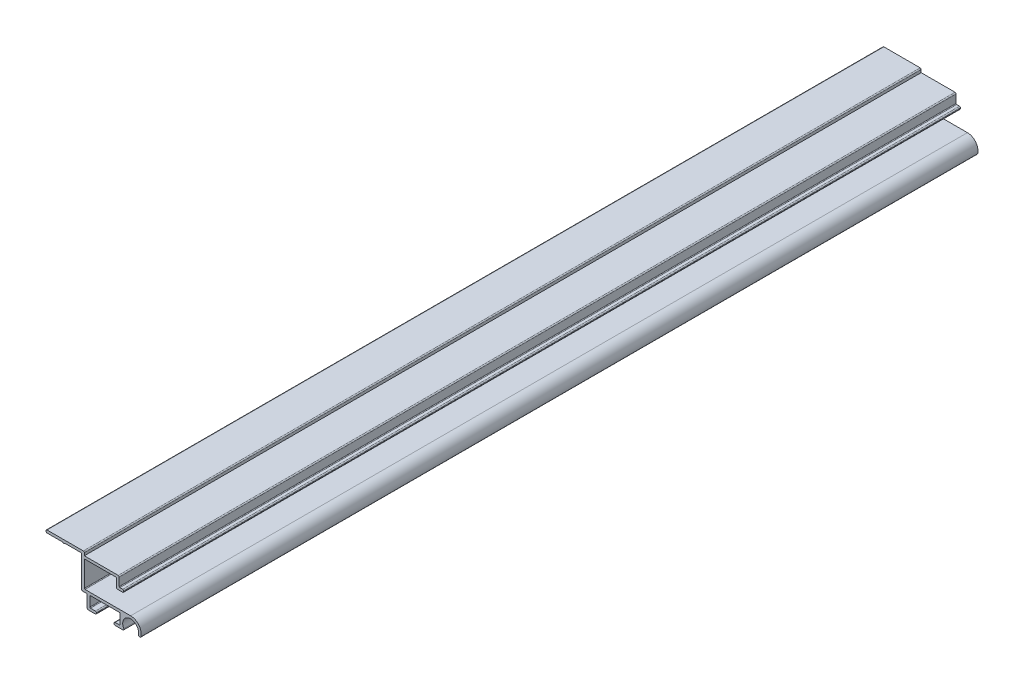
ISO-10303-21;
HEADER;
FILE_DESCRIPTION(('STEP AP214'),'2;1');
FILE_NAME('part.step','',(''),(''),'','','');
FILE_SCHEMA(('AUTOMOTIVE_DESIGN { 1 0 10303 214 1 1 1 1 }'));
ENDSEC;
DATA;
#1=APPLICATION_CONTEXT('core data for automotive mechanical design processes');
#2=APPLICATION_PROTOCOL_DEFINITION('international standard','automotive_design',2000,#1);
#3=PRODUCT_CONTEXT('',#1,'mechanical');
#4=PRODUCT('Part','Part','',(#3));
#5=PRODUCT_RELATED_PRODUCT_CATEGORY('part','',(#4));
#6=PRODUCT_DEFINITION_FORMATION('','',#4);
#7=PRODUCT_DEFINITION_CONTEXT('part definition',#1,'design');
#8=PRODUCT_DEFINITION('design','',#6,#7);
#9=PRODUCT_DEFINITION_SHAPE('','',#8);
#10=(LENGTH_UNIT() NAMED_UNIT(*) SI_UNIT(.MILLI.,.METRE.));
#11=(NAMED_UNIT(*) PLANE_ANGLE_UNIT() SI_UNIT($,.RADIAN.));
#12=(NAMED_UNIT(*) SI_UNIT($,.STERADIAN.) SOLID_ANGLE_UNIT());
#13=UNCERTAINTY_MEASURE_WITH_UNIT(LENGTH_MEASURE(1.E-05),#10,'distance_accuracy_value','');
#14=(GEOMETRIC_REPRESENTATION_CONTEXT(3) GLOBAL_UNCERTAINTY_ASSIGNED_CONTEXT((#13)) GLOBAL_UNIT_ASSIGNED_CONTEXT((#10,
#11,#12)) REPRESENTATION_CONTEXT('',''));
#15=CARTESIAN_POINT('',(0.,0.,0.));
#16=DIRECTION('',(0.,0.,1.));
#17=DIRECTION('',(1.,0.,0.));
#18=AXIS2_PLACEMENT_3D('',#15,#16,#17);
#19=CARTESIAN_POINT('',(0.400000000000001,-11.9,316.5));
#20=DIRECTION('',(0.,0.,-1.));
#21=DIRECTION('',(-1.,0.,0.));
#22=AXIS2_PLACEMENT_3D('',#19,#20,#21);
#23=CYLINDRICAL_SURFACE('',#22,0.399999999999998);
#24=CARTESIAN_POINT('',(0.400000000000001,-11.9,0.));
#25=DIRECTION('',(0.,0.,1.));
#26=DIRECTION('',(1.,0.,0.));
#27=AXIS2_PLACEMENT_3D('',#24,#25,#26);
#28=CIRCLE('',#27,0.399999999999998);
#29=CARTESIAN_POINT('',(0.,-11.9,0.));
#30=VERTEX_POINT('',#29);
#31=CARTESIAN_POINT('',(0.400000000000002,-12.3,0.));
#32=VERTEX_POINT('',#31);
#33=EDGE_CURVE('E417',#30,#32,#28,.T.);
#34=ORIENTED_EDGE('',*,*,#33,.T.);
#35=DIRECTION('',(0.,0.,-1.));
#36=VECTOR('',#35,1.);
#37=CARTESIAN_POINT('',(0.400000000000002,-12.3,316.5));
#38=LINE('',#37,#36);
#39=CARTESIAN_POINT('',(0.400000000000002,-12.3,316.5));
#40=VERTEX_POINT('',#39);
#41=EDGE_CURVE('E41',#40,#32,#38,.T.);
#42=ORIENTED_EDGE('',*,*,#41,.F.);
#43=CARTESIAN_POINT('',(0.400000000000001,-11.9,316.5));
#44=DIRECTION('',(0.,0.,1.));
#45=DIRECTION('',(1.,0.,0.));
#46=AXIS2_PLACEMENT_3D('',#43,#44,#45);
#47=CIRCLE('',#46,0.399999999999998);
#48=CARTESIAN_POINT('',(0.,-11.9,316.5));
#49=VERTEX_POINT('',#48);
#50=EDGE_CURVE('E688',#49,#40,#47,.T.);
#51=ORIENTED_EDGE('',*,*,#50,.F.);
#52=DIRECTION('',(0.,0.,-1.));
#53=VECTOR('',#52,1.);
#54=CARTESIAN_POINT('',(0.,-11.9,316.5));
#55=LINE('',#54,#53);
#56=EDGE_CURVE('E11',#49,#30,#55,.T.);
#57=ORIENTED_EDGE('',*,*,#56,.T.);
#58=EDGE_LOOP('',(#34,#42,#51,#57));
#59=FACE_BOUND('',#58,.T.);
#60=ADVANCED_FACE('F33',(#59),#23,.T.);
#61=CARTESIAN_POINT('',(1.,-12.3,316.5));
#62=DIRECTION('',(0.,1.,0.));
#63=DIRECTION('',(0.,0.,1.));
#64=AXIS2_PLACEMENT_3D('',#61,#62,#63);
#65=PLANE('',#64);
#66=DIRECTION('',(1.,0.,0.));
#67=VECTOR('',#66,1.);
#68=CARTESIAN_POINT('',(1.,-12.3,0.));
#69=LINE('',#68,#67);
#70=CARTESIAN_POINT('',(1.80731682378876,-12.3,0.));
#71=VERTEX_POINT('',#70);
#72=EDGE_CURVE('E420',#32,#71,#69,.T.);
#73=ORIENTED_EDGE('',*,*,#72,.T.);
#74=DIRECTION('',(0.,0.,-1.));
#75=VECTOR('',#74,1.);
#76=CARTESIAN_POINT('',(1.80731682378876,-12.3,316.5));
#77=LINE('',#76,#75);
#78=CARTESIAN_POINT('',(1.80731682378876,-12.3,316.5));
#79=VERTEX_POINT('',#78);
#80=EDGE_CURVE('E677',#79,#71,#77,.T.);
#81=ORIENTED_EDGE('',*,*,#80,.F.);
#82=DIRECTION('',(1.,0.,0.));
#83=VECTOR('',#82,1.);
#84=CARTESIAN_POINT('',(1.,-12.3,316.5));
#85=LINE('',#84,#83);
#86=EDGE_CURVE('E685',#40,#79,#85,.T.);
#87=ORIENTED_EDGE('',*,*,#86,.F.);
#88=ORIENTED_EDGE('',*,*,#41,.T.);
#89=EDGE_LOOP('',(#73,#81,#87,#88));
#90=FACE_BOUND('',#89,.T.);
#91=ADVANCED_FACE('F683',(#90),#65,.F.);
#92=CARTESIAN_POINT('',(1.80731682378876,-12.55,316.5));
#93=DIRECTION('',(0.,0.,-1.));
#94=DIRECTION('',(-1.,0.,0.));
#95=AXIS2_PLACEMENT_3D('',#92,#93,#94);
#96=CYLINDRICAL_SURFACE('',#95,0.25);
#97=CARTESIAN_POINT('',(1.80731682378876,-12.55,0.));
#98=DIRECTION('',(0.,0.,-1.));
#99=DIRECTION('',(1.,0.,0.));
#100=AXIS2_PLACEMENT_3D('',#97,#98,#99);
#101=CIRCLE('',#100,0.25);
#102=CARTESIAN_POINT('',(2.05731682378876,-12.55,0.));
#103=VERTEX_POINT('',#102);
#104=EDGE_CURVE('E422',#71,#103,#101,.T.);
#105=ORIENTED_EDGE('',*,*,#104,.T.);
#106=DIRECTION('',(0.,0.,-1.));
#107=VECTOR('',#106,1.);
#108=CARTESIAN_POINT('',(2.05731682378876,-12.55,316.5));
#109=LINE('',#108,#107);
#110=CARTESIAN_POINT('',(2.05731682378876,-12.55,316.5));
#111=VERTEX_POINT('',#110);
#112=EDGE_CURVE('E674',#111,#103,#109,.T.);
#113=ORIENTED_EDGE('',*,*,#112,.F.);
#114=CARTESIAN_POINT('',(1.80731682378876,-12.55,316.5));
#115=DIRECTION('',(0.,0.,-1.));
#116=DIRECTION('',(1.,0.,0.));
#117=AXIS2_PLACEMENT_3D('',#114,#115,#116);
#118=CIRCLE('',#117,0.25);
#119=EDGE_CURVE('E707',#79,#111,#118,.T.);
#120=ORIENTED_EDGE('',*,*,#119,.F.);
#121=ORIENTED_EDGE('',*,*,#80,.T.);
#122=EDGE_LOOP('',(#105,#113,#120,#121));
#123=FACE_BOUND('',#122,.T.);
#124=ADVANCED_FACE('F698',(#123),#96,.F.);
#125=CARTESIAN_POINT('',(2.05731682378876,-12.55,316.5));
#126=DIRECTION('',(1.,0.,0.));
#127=DIRECTION('',(0.,1.,0.));
#128=AXIS2_PLACEMENT_3D('',#125,#126,#127);
#129=PLANE('',#128);
#130=DIRECTION('',(0.,-1.,0.));
#131=VECTOR('',#130,1.);
#132=CARTESIAN_POINT('',(2.05731682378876,-12.55,0.));
#133=LINE('',#132,#131);
#134=CARTESIAN_POINT('',(2.05731682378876,-17.,0.));
#135=VERTEX_POINT('',#134);
#136=EDGE_CURVE('E424',#103,#135,#133,.T.);
#137=ORIENTED_EDGE('',*,*,#136,.T.);
#138=DIRECTION('',(0.,0.,-1.));
#139=VECTOR('',#138,1.);
#140=CARTESIAN_POINT('',(2.05731682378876,-17.,316.5));
#141=LINE('',#140,#139);
#142=CARTESIAN_POINT('',(2.05731682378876,-17.,316.5));
#143=VERTEX_POINT('',#142);
#144=EDGE_CURVE('E671',#143,#135,#141,.T.);
#145=ORIENTED_EDGE('',*,*,#144,.F.);
#146=DIRECTION('',(0.,-1.,0.));
#147=VECTOR('',#146,1.);
#148=CARTESIAN_POINT('',(2.05731682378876,-12.55,316.5));
#149=LINE('',#148,#147);
#150=EDGE_CURVE('E704',#111,#143,#149,.T.);
#151=ORIENTED_EDGE('',*,*,#150,.F.);
#152=ORIENTED_EDGE('',*,*,#112,.T.);
#153=EDGE_LOOP('',(#137,#145,#151,#152));
#154=FACE_BOUND('',#153,.T.);
#155=ADVANCED_FACE('F702',(#154),#129,.F.);
#156=CARTESIAN_POINT('',(2.45731682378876,-17.,316.5));
#157=DIRECTION('',(0.,0.,-1.));
#158=DIRECTION('',(-1.,0.,0.));
#159=AXIS2_PLACEMENT_3D('',#156,#157,#158);
#160=CYLINDRICAL_SURFACE('',#159,0.400000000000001);
#161=CARTESIAN_POINT('',(2.45731682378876,-17.,0.));
#162=DIRECTION('',(0.,0.,1.));
#163=DIRECTION('',(1.,0.,0.));
#164=AXIS2_PLACEMENT_3D('',#161,#162,#163);
#165=CIRCLE('',#164,0.400000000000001);
#166=CARTESIAN_POINT('',(2.45731682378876,-17.4,0.));
#167=VERTEX_POINT('',#166);
#168=EDGE_CURVE('E426',#135,#167,#165,.T.);
#169=ORIENTED_EDGE('',*,*,#168,.T.);
#170=DIRECTION('',(0.,0.,-1.));
#171=VECTOR('',#170,1.);
#172=CARTESIAN_POINT('',(2.45731682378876,-17.4,316.5));
#173=LINE('',#172,#171);
#174=CARTESIAN_POINT('',(2.45731682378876,-17.4,316.5));
#175=VERTEX_POINT('',#174);
#176=EDGE_CURVE('E668',#175,#167,#173,.T.);
#177=ORIENTED_EDGE('',*,*,#176,.F.);
#178=CARTESIAN_POINT('',(2.45731682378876,-17.,316.5));
#179=DIRECTION('',(0.,0.,1.));
#180=DIRECTION('',(1.,0.,0.));
#181=AXIS2_PLACEMENT_3D('',#178,#179,#180);
#182=CIRCLE('',#181,0.400000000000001);
#183=EDGE_CURVE('E706',#143,#175,#182,.T.);
#184=ORIENTED_EDGE('',*,*,#183,.F.);
#185=ORIENTED_EDGE('',*,*,#144,.T.);
#186=EDGE_LOOP('',(#169,#177,#184,#185));
#187=FACE_BOUND('',#186,.T.);
#188=ADVANCED_FACE('F1039',(#187),#160,.T.);
#189=CARTESIAN_POINT('',(2.45731682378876,-17.4,316.5));
#190=DIRECTION('',(0.,1.,0.));
#191=DIRECTION('',(0.,0.,1.));
#192=AXIS2_PLACEMENT_3D('',#189,#190,#191);
#193=PLANE('',#192);
#194=DIRECTION('',(1.,0.,0.));
#195=VECTOR('',#194,1.);
#196=CARTESIAN_POINT('',(2.45731682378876,-17.4,0.));
#197=LINE('',#196,#195);
#198=CARTESIAN_POINT('',(5.15731682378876,-17.4,0.));
#199=VERTEX_POINT('',#198);
#200=EDGE_CURVE('E428',#167,#199,#197,.T.);
#201=ORIENTED_EDGE('',*,*,#200,.T.);
#202=DIRECTION('',(0.,0.,-1.));
#203=VECTOR('',#202,1.);
#204=CARTESIAN_POINT('',(5.15731682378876,-17.4,316.5));
#205=LINE('',#204,#203);
#206=CARTESIAN_POINT('',(5.15731682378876,-17.4,316.5));
#207=VERTEX_POINT('',#206);
#208=EDGE_CURVE('E665',#207,#199,#205,.T.);
#209=ORIENTED_EDGE('',*,*,#208,.F.);
#210=DIRECTION('',(1.,0.,0.));
#211=VECTOR('',#210,1.);
#212=CARTESIAN_POINT('',(2.45731682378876,-17.4,316.5));
#213=LINE('',#212,#211);
#214=EDGE_CURVE('E709',#175,#207,#213,.T.);
#215=ORIENTED_EDGE('',*,*,#214,.F.);
#216=ORIENTED_EDGE('',*,*,#176,.T.);
#217=EDGE_LOOP('',(#201,#209,#215,#216));
#218=FACE_BOUND('',#217,.T.);
#219=ADVANCED_FACE('F1036',(#218),#193,.F.);
#220=CARTESIAN_POINT('',(5.15731682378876,-17.,316.5));
#221=DIRECTION('',(0.,0.,-1.));
#222=DIRECTION('',(-1.,0.,0.));
#223=AXIS2_PLACEMENT_3D('',#220,#221,#222);
#224=CYLINDRICAL_SURFACE('',#223,0.400000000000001);
#225=CARTESIAN_POINT('',(5.15731682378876,-17.,0.));
#226=DIRECTION('',(0.,0.,1.));
#227=DIRECTION('',(1.,0.,0.));
#228=AXIS2_PLACEMENT_3D('',#225,#226,#227);
#229=CIRCLE('',#228,0.400000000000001);
#230=CARTESIAN_POINT('',(5.55731682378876,-17.,0.));
#231=VERTEX_POINT('',#230);
#232=EDGE_CURVE('E430',#199,#231,#229,.T.);
#233=ORIENTED_EDGE('',*,*,#232,.T.);
#234=DIRECTION('',(0.,0.,-1.));
#235=VECTOR('',#234,1.);
#236=CARTESIAN_POINT('',(5.55731682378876,-17.,316.5));
#237=LINE('',#236,#235);
#238=CARTESIAN_POINT('',(5.55731682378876,-17.,316.5));
#239=VERTEX_POINT('',#238);
#240=EDGE_CURVE('E662',#239,#231,#237,.T.);
#241=ORIENTED_EDGE('',*,*,#240,.F.);
#242=CARTESIAN_POINT('',(5.15731682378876,-17.,316.5));
#243=DIRECTION('',(0.,0.,1.));
#244=DIRECTION('',(1.,0.,0.));
#245=AXIS2_PLACEMENT_3D('',#242,#243,#244);
#246=CIRCLE('',#245,0.400000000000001);
#247=EDGE_CURVE('E715',#207,#239,#246,.T.);
#248=ORIENTED_EDGE('',*,*,#247,.F.);
#249=ORIENTED_EDGE('',*,*,#208,.T.);
#250=EDGE_LOOP('',(#233,#241,#248,#249));
#251=FACE_BOUND('',#250,.T.);
#252=ADVANCED_FACE('F1032',(#251),#224,.T.);
#253=CARTESIAN_POINT('',(5.55731682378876,-16.8,316.5));
#254=DIRECTION('',(-1.,0.,0.));
#255=DIRECTION('',(0.,0.,1.));
#256=AXIS2_PLACEMENT_3D('',#253,#254,#255);
#257=PLANE('',#256);
#258=DIRECTION('',(0.,1.,0.));
#259=VECTOR('',#258,1.);
#260=CARTESIAN_POINT('',(5.55731682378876,-16.8,0.));
#261=LINE('',#260,#259);
#262=CARTESIAN_POINT('',(5.55731682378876,-16.8,0.));
#263=VERTEX_POINT('',#262);
#264=EDGE_CURVE('E432',#231,#263,#261,.T.);
#265=ORIENTED_EDGE('',*,*,#264,.T.);
#266=DIRECTION('',(0.,0.,-1.));
#267=VECTOR('',#266,1.);
#268=CARTESIAN_POINT('',(5.55731682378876,-16.8,316.5));
#269=LINE('',#268,#267);
#270=CARTESIAN_POINT('',(5.55731682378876,-16.8,316.5));
#271=VERTEX_POINT('',#270);
#272=EDGE_CURVE('E659',#271,#263,#269,.T.);
#273=ORIENTED_EDGE('',*,*,#272,.F.);
#274=DIRECTION('',(0.,1.,0.));
#275=VECTOR('',#274,1.);
#276=CARTESIAN_POINT('',(5.55731682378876,-16.8,316.5));
#277=LINE('',#276,#275);
#278=EDGE_CURVE('E717',#239,#271,#277,.T.);
#279=ORIENTED_EDGE('',*,*,#278,.F.);
#280=ORIENTED_EDGE('',*,*,#240,.T.);
#281=EDGE_LOOP('',(#265,#273,#279,#280));
#282=FACE_BOUND('',#281,.T.);
#283=ADVANCED_FACE('F1027',(#282),#257,.F.);
#284=CARTESIAN_POINT('',(5.15731682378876,-16.8,316.5));
#285=DIRECTION('',(0.,0.,-1.));
#286=DIRECTION('',(-1.,0.,0.));
#287=AXIS2_PLACEMENT_3D('',#284,#285,#286);
#288=CYLINDRICAL_SURFACE('',#287,0.400000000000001);
#289=CARTESIAN_POINT('',(5.15731682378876,-16.8,0.));
#290=DIRECTION('',(0.,0.,1.));
#291=DIRECTION('',(-1.,0.,0.));
#292=AXIS2_PLACEMENT_3D('',#289,#290,#291);
#293=CIRCLE('',#292,0.400000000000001);
#294=CARTESIAN_POINT('',(5.15731682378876,-16.4,0.));
#295=VERTEX_POINT('',#294);
#296=EDGE_CURVE('E434',#263,#295,#293,.T.);
#297=ORIENTED_EDGE('',*,*,#296,.T.);
#298=DIRECTION('',(0.,0.,-1.));
#299=VECTOR('',#298,1.);
#300=CARTESIAN_POINT('',(5.15731682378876,-16.4,316.5));
#301=LINE('',#300,#299);
#302=CARTESIAN_POINT('',(5.15731682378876,-16.4,316.5));
#303=VERTEX_POINT('',#302);
#304=EDGE_CURVE('E656',#303,#295,#301,.T.);
#305=ORIENTED_EDGE('',*,*,#304,.F.);
#306=CARTESIAN_POINT('',(5.15731682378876,-16.8,316.5));
#307=DIRECTION('',(0.,0.,1.));
#308=DIRECTION('',(-1.,0.,0.));
#309=AXIS2_PLACEMENT_3D('',#306,#307,#308);
#310=CIRCLE('',#309,0.400000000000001);
#311=EDGE_CURVE('E719',#271,#303,#310,.T.);
#312=ORIENTED_EDGE('',*,*,#311,.F.);
#313=ORIENTED_EDGE('',*,*,#272,.T.);
#314=EDGE_LOOP('',(#297,#305,#312,#313));
#315=FACE_BOUND('',#314,.T.);
#316=ADVANCED_FACE('F1021',(#315),#288,.T.);
#317=CARTESIAN_POINT('',(3.30731682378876,-16.4,316.5));
#318=DIRECTION('',(0.,-1.,0.));
#319=DIRECTION('',(0.,0.,-1.));
#320=AXIS2_PLACEMENT_3D('',#317,#318,#319);
#321=PLANE('',#320);
#322=DIRECTION('',(-1.,0.,0.));
#323=VECTOR('',#322,1.);
#324=CARTESIAN_POINT('',(3.30731682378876,-16.4,0.));
#325=LINE('',#324,#323);
#326=CARTESIAN_POINT('',(3.30731682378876,-16.4,0.));
#327=VERTEX_POINT('',#326);
#328=EDGE_CURVE('E436',#295,#327,#325,.T.);
#329=ORIENTED_EDGE('',*,*,#328,.T.);
#330=DIRECTION('',(0.,0.,-1.));
#331=VECTOR('',#330,1.);
#332=CARTESIAN_POINT('',(3.30731682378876,-16.4,316.5));
#333=LINE('',#332,#331);
#334=CARTESIAN_POINT('',(3.30731682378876,-16.4,316.5));
#335=VERTEX_POINT('',#334);
#336=EDGE_CURVE('E653',#335,#327,#333,.T.);
#337=ORIENTED_EDGE('',*,*,#336,.F.);
#338=DIRECTION('',(-1.,0.,0.));
#339=VECTOR('',#338,1.);
#340=CARTESIAN_POINT('',(3.30731682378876,-16.4,316.5));
#341=LINE('',#340,#339);
#342=EDGE_CURVE('E721',#303,#335,#341,.T.);
#343=ORIENTED_EDGE('',*,*,#342,.F.);
#344=ORIENTED_EDGE('',*,*,#304,.T.);
#345=EDGE_LOOP('',(#329,#337,#343,#344));
#346=FACE_BOUND('',#345,.T.);
#347=ADVANCED_FACE('F1017',(#346),#321,.F.);
#348=CARTESIAN_POINT('',(3.30731682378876,-16.15,316.5));
#349=DIRECTION('',(0.,0.,-1.));
#350=DIRECTION('',(-1.,0.,0.));
#351=AXIS2_PLACEMENT_3D('',#348,#349,#350);
#352=CYLINDRICAL_SURFACE('',#351,0.25);
#353=CARTESIAN_POINT('',(3.30731682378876,-16.15,0.));
#354=DIRECTION('',(0.,0.,-1.));
#355=DIRECTION('',(1.,0.,0.));
#356=AXIS2_PLACEMENT_3D('',#353,#354,#355);
#357=CIRCLE('',#356,0.25);
#358=CARTESIAN_POINT('',(3.05731682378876,-16.15,0.));
#359=VERTEX_POINT('',#358);
#360=EDGE_CURVE('E438',#327,#359,#357,.T.);
#361=ORIENTED_EDGE('',*,*,#360,.T.);
#362=DIRECTION('',(0.,0.,-1.));
#363=VECTOR('',#362,1.);
#364=CARTESIAN_POINT('',(3.05731682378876,-16.15,316.5));
#365=LINE('',#364,#363);
#366=CARTESIAN_POINT('',(3.05731682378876,-16.15,316.5));
#367=VERTEX_POINT('',#366);
#368=EDGE_CURVE('E650',#367,#359,#365,.T.);
#369=ORIENTED_EDGE('',*,*,#368,.F.);
#370=CARTESIAN_POINT('',(3.30731682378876,-16.15,316.5));
#371=DIRECTION('',(0.,0.,-1.));
#372=DIRECTION('',(1.,0.,0.));
#373=AXIS2_PLACEMENT_3D('',#370,#371,#372);
#374=CIRCLE('',#373,0.25);
#375=EDGE_CURVE('E723',#335,#367,#374,.T.);
#376=ORIENTED_EDGE('',*,*,#375,.F.);
#377=ORIENTED_EDGE('',*,*,#336,.T.);
#378=EDGE_LOOP('',(#361,#369,#376,#377));
#379=FACE_BOUND('',#378,.T.);
#380=ADVANCED_FACE('F1012',(#379),#352,.F.);
#381=CARTESIAN_POINT('',(3.05731682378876,-12.55,316.5));
#382=DIRECTION('',(-1.,0.,0.));
#383=DIRECTION('',(0.,-1.,0.));
#384=AXIS2_PLACEMENT_3D('',#381,#382,#383);
#385=PLANE('',#384);
#386=DIRECTION('',(0.,1.,0.));
#387=VECTOR('',#386,1.);
#388=CARTESIAN_POINT('',(3.05731682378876,-12.55,0.));
#389=LINE('',#388,#387);
#390=CARTESIAN_POINT('',(3.05731682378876,-12.55,0.));
#391=VERTEX_POINT('',#390);
#392=EDGE_CURVE('E440',#359,#391,#389,.T.);
#393=ORIENTED_EDGE('',*,*,#392,.T.);
#394=DIRECTION('',(0.,0.,-1.));
#395=VECTOR('',#394,1.);
#396=CARTESIAN_POINT('',(3.05731682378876,-12.55,316.5));
#397=LINE('',#396,#395);
#398=CARTESIAN_POINT('',(3.05731682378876,-12.55,316.5));
#399=VERTEX_POINT('',#398);
#400=EDGE_CURVE('E647',#399,#391,#397,.T.);
#401=ORIENTED_EDGE('',*,*,#400,.F.);
#402=DIRECTION('',(0.,1.,0.));
#403=VECTOR('',#402,1.);
#404=CARTESIAN_POINT('',(3.05731682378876,-12.55,316.5));
#405=LINE('',#404,#403);
#406=EDGE_CURVE('E725',#367,#399,#405,.T.);
#407=ORIENTED_EDGE('',*,*,#406,.F.);
#408=ORIENTED_EDGE('',*,*,#368,.T.);
#409=EDGE_LOOP('',(#393,#401,#407,#408));
#410=FACE_BOUND('',#409,.T.);
#411=ADVANCED_FACE('F1006',(#410),#385,.F.);
#412=CARTESIAN_POINT('',(3.30731682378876,-12.55,316.5));
#413=DIRECTION('',(0.,0.,-1.));
#414=DIRECTION('',(-1.,0.,0.));
#415=AXIS2_PLACEMENT_3D('',#412,#413,#414);
#416=CYLINDRICAL_SURFACE('',#415,0.25);
#417=CARTESIAN_POINT('',(3.30731682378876,-12.55,0.));
#418=DIRECTION('',(0.,0.,-1.));
#419=DIRECTION('',(-1.,0.,0.));
#420=AXIS2_PLACEMENT_3D('',#417,#418,#419);
#421=CIRCLE('',#420,0.25);
#422=CARTESIAN_POINT('',(3.30731682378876,-12.3,0.));
#423=VERTEX_POINT('',#422);
#424=EDGE_CURVE('E442',#391,#423,#421,.T.);
#425=ORIENTED_EDGE('',*,*,#424,.T.);
#426=DIRECTION('',(0.,0.,-1.));
#427=VECTOR('',#426,1.);
#428=CARTESIAN_POINT('',(3.30731682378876,-12.3,316.5));
#429=LINE('',#428,#427);
#430=CARTESIAN_POINT('',(3.30731682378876,-12.3,316.5));
#431=VERTEX_POINT('',#430);
#432=EDGE_CURVE('E644',#431,#423,#429,.T.);
#433=ORIENTED_EDGE('',*,*,#432,.F.);
#434=CARTESIAN_POINT('',(3.30731682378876,-12.55,316.5));
#435=DIRECTION('',(0.,0.,-1.));
#436=DIRECTION('',(-1.,0.,0.));
#437=AXIS2_PLACEMENT_3D('',#434,#435,#436);
#438=CIRCLE('',#437,0.25);
#439=EDGE_CURVE('E727',#399,#431,#438,.T.);
#440=ORIENTED_EDGE('',*,*,#439,.F.);
#441=ORIENTED_EDGE('',*,*,#400,.T.);
#442=EDGE_LOOP('',(#425,#433,#440,#441));
#443=FACE_BOUND('',#442,.T.);
#444=ADVANCED_FACE('F1002',(#443),#416,.F.);
#445=CARTESIAN_POINT('',(3.30731682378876,-12.3,316.5));
#446=DIRECTION('',(0.,1.,0.));
#447=DIRECTION('',(-1.,0.,0.));
#448=AXIS2_PLACEMENT_3D('',#445,#446,#447);
#449=PLANE('',#448);
#450=DIRECTION('',(1.,0.,0.));
#451=VECTOR('',#450,1.);
#452=CARTESIAN_POINT('',(3.30731682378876,-12.3,0.));
#453=LINE('',#452,#451);
#454=CARTESIAN_POINT('',(14.25,-12.3,0.));
#455=VERTEX_POINT('',#454);
#456=EDGE_CURVE('E444',#423,#455,#453,.T.);
#457=ORIENTED_EDGE('',*,*,#456,.T.);
#458=DIRECTION('',(0.,0.,-1.));
#459=VECTOR('',#458,1.);
#460=CARTESIAN_POINT('',(14.25,-12.3,316.5));
#461=LINE('',#460,#459);
#462=CARTESIAN_POINT('',(14.25,-12.3,316.5));
#463=VERTEX_POINT('',#462);
#464=EDGE_CURVE('E641',#463,#455,#461,.T.);
#465=ORIENTED_EDGE('',*,*,#464,.F.);
#466=DIRECTION('',(1.,0.,0.));
#467=VECTOR('',#466,1.);
#468=CARTESIAN_POINT('',(3.30731682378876,-12.3,316.5));
#469=LINE('',#468,#467);
#470=EDGE_CURVE('E729',#431,#463,#469,.T.);
#471=ORIENTED_EDGE('',*,*,#470,.F.);
#472=ORIENTED_EDGE('',*,*,#432,.T.);
#473=EDGE_LOOP('',(#457,#465,#471,#472));
#474=FACE_BOUND('',#473,.T.);
#475=ADVANCED_FACE('F997',(#474),#449,.F.);
#476=CARTESIAN_POINT('',(14.25,-12.55,316.5));
#477=DIRECTION('',(0.,0.,-1.));
#478=DIRECTION('',(-1.,0.,0.));
#479=AXIS2_PLACEMENT_3D('',#476,#477,#478);
#480=CYLINDRICAL_SURFACE('',#479,0.249999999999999);
#481=CARTESIAN_POINT('',(14.25,-12.55,0.));
#482=DIRECTION('',(0.,0.,-1.));
#483=DIRECTION('',(1.,0.,0.));
#484=AXIS2_PLACEMENT_3D('',#481,#482,#483);
#485=CIRCLE('',#484,0.249999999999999);
#486=CARTESIAN_POINT('',(14.5,-12.55,0.));
#487=VERTEX_POINT('',#486);
#488=EDGE_CURVE('E446',#455,#487,#485,.T.);
#489=ORIENTED_EDGE('',*,*,#488,.T.);
#490=DIRECTION('',(0.,0.,-1.));
#491=VECTOR('',#490,1.);
#492=CARTESIAN_POINT('',(14.5,-12.55,316.5));
#493=LINE('',#492,#491);
#494=CARTESIAN_POINT('',(14.5,-12.55,316.5));
#495=VERTEX_POINT('',#494);
#496=EDGE_CURVE('E638',#495,#487,#493,.T.);
#497=ORIENTED_EDGE('',*,*,#496,.F.);
#498=CARTESIAN_POINT('',(14.25,-12.55,316.5));
#499=DIRECTION('',(0.,0.,-1.));
#500=DIRECTION('',(1.,0.,0.));
#501=AXIS2_PLACEMENT_3D('',#498,#499,#500);
#502=CIRCLE('',#501,0.249999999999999);
#503=EDGE_CURVE('E731',#463,#495,#502,.T.);
#504=ORIENTED_EDGE('',*,*,#503,.F.);
#505=ORIENTED_EDGE('',*,*,#464,.T.);
#506=EDGE_LOOP('',(#489,#497,#504,#505));
#507=FACE_BOUND('',#506,.T.);
#508=ADVANCED_FACE('F991',(#507),#480,.F.);
#509=CARTESIAN_POINT('',(14.5,-12.55,316.5));
#510=DIRECTION('',(1.,0.,0.));
#511=DIRECTION('',(0.,0.,-1.));
#512=AXIS2_PLACEMENT_3D('',#509,#510,#511);
#513=PLANE('',#512);
#514=DIRECTION('',(0.,-1.,0.));
#515=VECTOR('',#514,1.);
#516=CARTESIAN_POINT('',(14.5,-12.55,0.));
#517=LINE('',#516,#515);
#518=CARTESIAN_POINT('',(14.5,-16.15,0.));
#519=VERTEX_POINT('',#518);
#520=EDGE_CURVE('E448',#487,#519,#517,.T.);
#521=ORIENTED_EDGE('',*,*,#520,.T.);
#522=DIRECTION('',(0.,0.,-1.));
#523=VECTOR('',#522,1.);
#524=CARTESIAN_POINT('',(14.5,-16.15,316.5));
#525=LINE('',#524,#523);
#526=CARTESIAN_POINT('',(14.5,-16.15,316.5));
#527=VERTEX_POINT('',#526);
#528=EDGE_CURVE('E635',#527,#519,#525,.T.);
#529=ORIENTED_EDGE('',*,*,#528,.F.);
#530=DIRECTION('',(0.,-1.,0.));
#531=VECTOR('',#530,1.);
#532=CARTESIAN_POINT('',(14.5,-12.55,316.5));
#533=LINE('',#532,#531);
#534=EDGE_CURVE('E733',#495,#527,#533,.T.);
#535=ORIENTED_EDGE('',*,*,#534,.F.);
#536=ORIENTED_EDGE('',*,*,#496,.T.);
#537=EDGE_LOOP('',(#521,#529,#535,#536));
#538=FACE_BOUND('',#537,.T.);
#539=ADVANCED_FACE('F987',(#538),#513,.F.);
#540=CARTESIAN_POINT('',(14.25,-16.15,316.5));
#541=DIRECTION('',(0.,0.,-1.));
#542=DIRECTION('',(-1.,0.,0.));
#543=AXIS2_PLACEMENT_3D('',#540,#541,#542);
#544=CYLINDRICAL_SURFACE('',#543,0.25);
#545=CARTESIAN_POINT('',(14.25,-16.15,0.));
#546=DIRECTION('',(0.,0.,-1.));
#547=DIRECTION('',(-1.,0.,0.));
#548=AXIS2_PLACEMENT_3D('',#545,#546,#547);
#549=CIRCLE('',#548,0.25);
#550=CARTESIAN_POINT('',(14.25,-16.4,0.));
#551=VERTEX_POINT('',#550);
#552=EDGE_CURVE('E450',#519,#551,#549,.T.);
#553=ORIENTED_EDGE('',*,*,#552,.T.);
#554=DIRECTION('',(0.,0.,-1.));
#555=VECTOR('',#554,1.);
#556=CARTESIAN_POINT('',(14.25,-16.4,316.5));
#557=LINE('',#556,#555);
#558=CARTESIAN_POINT('',(14.25,-16.4,316.5));
#559=VERTEX_POINT('',#558);
#560=EDGE_CURVE('E632',#559,#551,#557,.T.);
#561=ORIENTED_EDGE('',*,*,#560,.F.);
#562=CARTESIAN_POINT('',(14.25,-16.15,316.5));
#563=DIRECTION('',(0.,0.,-1.));
#564=DIRECTION('',(-1.,0.,0.));
#565=AXIS2_PLACEMENT_3D('',#562,#563,#564);
#566=CIRCLE('',#565,0.25);
#567=EDGE_CURVE('E735',#527,#559,#566,.T.);
#568=ORIENTED_EDGE('',*,*,#567,.F.);
#569=ORIENTED_EDGE('',*,*,#528,.T.);
#570=EDGE_LOOP('',(#553,#561,#568,#569));
#571=FACE_BOUND('',#570,.T.);
#572=ADVANCED_FACE('F982',(#571),#544,.F.);
#573=CARTESIAN_POINT('',(12.6573168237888,-16.4,316.5));
#574=DIRECTION('',(0.,-1.,0.));
#575=DIRECTION('',(0.,0.,-1.));
#576=AXIS2_PLACEMENT_3D('',#573,#574,#575);
#577=PLANE('',#576);
#578=DIRECTION('',(-1.,0.,0.));
#579=VECTOR('',#578,1.);
#580=CARTESIAN_POINT('',(12.6573168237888,-16.4,0.));
#581=LINE('',#580,#579);
#582=CARTESIAN_POINT('',(12.6573168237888,-16.4,0.));
#583=VERTEX_POINT('',#582);
#584=EDGE_CURVE('E452',#551,#583,#581,.T.);
#585=ORIENTED_EDGE('',*,*,#584,.T.);
#586=DIRECTION('',(0.,0.,-1.));
#587=VECTOR('',#586,1.);
#588=CARTESIAN_POINT('',(12.6573168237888,-16.4,316.5));
#589=LINE('',#588,#587);
#590=CARTESIAN_POINT('',(12.6573168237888,-16.4,316.5));
#591=VERTEX_POINT('',#590);
#592=EDGE_CURVE('E629',#591,#583,#589,.T.);
#593=ORIENTED_EDGE('',*,*,#592,.F.);
#594=DIRECTION('',(-1.,0.,0.));
#595=VECTOR('',#594,1.);
#596=CARTESIAN_POINT('',(12.6573168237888,-16.4,316.5));
#597=LINE('',#596,#595);
#598=EDGE_CURVE('E737',#559,#591,#597,.T.);
#599=ORIENTED_EDGE('',*,*,#598,.F.);
#600=ORIENTED_EDGE('',*,*,#560,.T.);
#601=EDGE_LOOP('',(#585,#593,#599,#600));
#602=FACE_BOUND('',#601,.T.);
#603=ADVANCED_FACE('F976',(#602),#577,.F.);
#604=CARTESIAN_POINT('',(12.6573168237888,-16.8,316.5));
#605=DIRECTION('',(0.,0.,-1.));
#606=DIRECTION('',(-1.,0.,0.));
#607=AXIS2_PLACEMENT_3D('',#604,#605,#606);
#608=CYLINDRICAL_SURFACE('',#607,0.4);
#609=CARTESIAN_POINT('',(12.6573168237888,-16.8,0.));
#610=DIRECTION('',(0.,0.,1.));
#611=DIRECTION('',(-1.,0.,0.));
#612=AXIS2_PLACEMENT_3D('',#609,#610,#611);
#613=CIRCLE('',#612,0.4);
#614=CARTESIAN_POINT('',(12.2573168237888,-16.8,0.));
#615=VERTEX_POINT('',#614);
#616=EDGE_CURVE('E454',#583,#615,#613,.T.);
#617=ORIENTED_EDGE('',*,*,#616,.T.);
#618=DIRECTION('',(0.,0.,-1.));
#619=VECTOR('',#618,1.);
#620=CARTESIAN_POINT('',(12.2573168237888,-16.8,316.5));
#621=LINE('',#620,#619);
#622=CARTESIAN_POINT('',(12.2573168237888,-16.8,316.5));
#623=VERTEX_POINT('',#622);
#624=EDGE_CURVE('E626',#623,#615,#621,.T.);
#625=ORIENTED_EDGE('',*,*,#624,.F.);
#626=CARTESIAN_POINT('',(12.6573168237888,-16.8,316.5));
#627=DIRECTION('',(0.,0.,1.));
#628=DIRECTION('',(-1.,0.,0.));
#629=AXIS2_PLACEMENT_3D('',#626,#627,#628);
#630=CIRCLE('',#629,0.4);
#631=EDGE_CURVE('E739',#591,#623,#630,.T.);
#632=ORIENTED_EDGE('',*,*,#631,.F.);
#633=ORIENTED_EDGE('',*,*,#592,.T.);
#634=EDGE_LOOP('',(#617,#625,#632,#633));
#635=FACE_BOUND('',#634,.T.);
#636=ADVANCED_FACE('F972',(#635),#608,.T.);
#637=CARTESIAN_POINT('',(12.2573168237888,-17.,316.5));
#638=DIRECTION('',(1.,0.,0.));
#639=DIRECTION('',(0.,0.,-1.));
#640=AXIS2_PLACEMENT_3D('',#637,#638,#639);
#641=PLANE('',#640);
#642=DIRECTION('',(0.,-1.,0.));
#643=VECTOR('',#642,1.);
#644=CARTESIAN_POINT('',(12.2573168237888,-17.,0.));
#645=LINE('',#644,#643);
#646=CARTESIAN_POINT('',(12.2573168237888,-17.,0.));
#647=VERTEX_POINT('',#646);
#648=EDGE_CURVE('E456',#615,#647,#645,.T.);
#649=ORIENTED_EDGE('',*,*,#648,.T.);
#650=DIRECTION('',(0.,0.,-1.));
#651=VECTOR('',#650,1.);
#652=CARTESIAN_POINT('',(12.2573168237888,-17.,316.5));
#653=LINE('',#652,#651);
#654=CARTESIAN_POINT('',(12.2573168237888,-17.,316.5));
#655=VERTEX_POINT('',#654);
#656=EDGE_CURVE('E623',#655,#647,#653,.T.);
#657=ORIENTED_EDGE('',*,*,#656,.F.);
#658=DIRECTION('',(0.,-1.,0.));
#659=VECTOR('',#658,1.);
#660=CARTESIAN_POINT('',(12.2573168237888,-17.,316.5));
#661=LINE('',#660,#659);
#662=EDGE_CURVE('E741',#623,#655,#661,.T.);
#663=ORIENTED_EDGE('',*,*,#662,.F.);
#664=ORIENTED_EDGE('',*,*,#624,.T.);
#665=EDGE_LOOP('',(#649,#657,#663,#664));
#666=FACE_BOUND('',#665,.T.);
#667=ADVANCED_FACE('F967',(#666),#641,.F.);
#668=CARTESIAN_POINT('',(12.6573168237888,-17.,316.5));
#669=DIRECTION('',(0.,0.,-1.));
#670=DIRECTION('',(-1.,0.,0.));
#671=AXIS2_PLACEMENT_3D('',#668,#669,#670);
#672=CYLINDRICAL_SURFACE('',#671,0.4);
#673=CARTESIAN_POINT('',(12.6573168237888,-17.,0.));
#674=DIRECTION('',(0.,0.,1.));
#675=DIRECTION('',(-1.,0.,0.));
#676=AXIS2_PLACEMENT_3D('',#673,#674,#675);
#677=CIRCLE('',#676,0.4);
#678=CARTESIAN_POINT('',(12.6573168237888,-17.4,0.));
#679=VERTEX_POINT('',#678);
#680=EDGE_CURVE('E458',#647,#679,#677,.T.);
#681=ORIENTED_EDGE('',*,*,#680,.T.);
#682=DIRECTION('',(0.,0.,-1.));
#683=VECTOR('',#682,1.);
#684=CARTESIAN_POINT('',(12.6573168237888,-17.4,316.5));
#685=LINE('',#684,#683);
#686=CARTESIAN_POINT('',(12.6573168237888,-17.4,316.5));
#687=VERTEX_POINT('',#686);
#688=EDGE_CURVE('E620',#687,#679,#685,.T.);
#689=ORIENTED_EDGE('',*,*,#688,.F.);
#690=CARTESIAN_POINT('',(12.6573168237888,-17.,316.5));
#691=DIRECTION('',(0.,0.,1.));
#692=DIRECTION('',(-1.,0.,0.));
#693=AXIS2_PLACEMENT_3D('',#690,#691,#692);
#694=CIRCLE('',#693,0.4);
#695=EDGE_CURVE('E743',#655,#687,#694,.T.);
#696=ORIENTED_EDGE('',*,*,#695,.F.);
#697=ORIENTED_EDGE('',*,*,#656,.T.);
#698=EDGE_LOOP('',(#681,#689,#696,#697));
#699=FACE_BOUND('',#698,.T.);
#700=ADVANCED_FACE('F961',(#699),#672,.T.);
#701=CARTESIAN_POINT('',(15.5553036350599,-17.4,316.5));
#702=DIRECTION('',(0.,1.,0.));
#703=DIRECTION('',(0.,0.,1.));
#704=AXIS2_PLACEMENT_3D('',#701,#702,#703);
#705=PLANE('',#704);
#706=DIRECTION('',(1.,0.,0.));
#707=VECTOR('',#706,1.);
#708=CARTESIAN_POINT('',(15.5553036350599,-17.4,0.));
#709=LINE('',#708,#707);
#710=CARTESIAN_POINT('',(15.5553036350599,-17.4,0.));
#711=VERTEX_POINT('',#710);
#712=EDGE_CURVE('E460',#679,#711,#709,.T.);
#713=ORIENTED_EDGE('',*,*,#712,.T.);
#714=DIRECTION('',(0.,0.,-1.));
#715=VECTOR('',#714,1.);
#716=CARTESIAN_POINT('',(15.5553036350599,-17.4,316.5));
#717=LINE('',#716,#715);
#718=CARTESIAN_POINT('',(15.5553036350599,-17.4,316.5));
#719=VERTEX_POINT('',#718);
#720=EDGE_CURVE('E617',#719,#711,#717,.T.);
#721=ORIENTED_EDGE('',*,*,#720,.F.);
#722=DIRECTION('',(1.,0.,0.));
#723=VECTOR('',#722,1.);
#724=CARTESIAN_POINT('',(15.5553036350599,-17.4,316.5));
#725=LINE('',#724,#723);
#726=EDGE_CURVE('E745',#687,#719,#725,.T.);
#727=ORIENTED_EDGE('',*,*,#726,.F.);
#728=ORIENTED_EDGE('',*,*,#688,.T.);
#729=EDGE_LOOP('',(#713,#721,#727,#728));
#730=FACE_BOUND('',#729,.T.);
#731=ADVANCED_FACE('F957',(#730),#705,.F.);
#732=CARTESIAN_POINT('',(15.5553036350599,-17.,316.5));
#733=DIRECTION('',(0.,0.,-1.));
#734=DIRECTION('',(-1.,0.,0.));
#735=AXIS2_PLACEMENT_3D('',#732,#733,#734);
#736=CYLINDRICAL_SURFACE('',#735,0.400000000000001);
#737=CARTESIAN_POINT('',(15.5553036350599,-17.,0.));
#738=DIRECTION('',(0.,0.,1.));
#739=DIRECTION('',(-1.,0.,0.));
#740=AXIS2_PLACEMENT_3D('',#737,#738,#739);
#741=CIRCLE('',#740,0.400000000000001);
#742=CARTESIAN_POINT('',(15.9017199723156,-16.8000106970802,0.));
#743=VERTEX_POINT('',#742);
#744=EDGE_CURVE('E462',#711,#743,#741,.T.);
#745=ORIENTED_EDGE('',*,*,#744,.T.);
#746=DIRECTION('',(0.,0.,-1.));
#747=VECTOR('',#746,1.);
#748=CARTESIAN_POINT('',(15.9017199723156,-16.8000106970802,316.5));
#749=LINE('',#748,#747);
#750=CARTESIAN_POINT('',(15.9017199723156,-16.8000106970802,316.5));
#751=VERTEX_POINT('',#750);
#752=EDGE_CURVE('E614',#751,#743,#749,.T.);
#753=ORIENTED_EDGE('',*,*,#752,.F.);
#754=CARTESIAN_POINT('',(15.5553036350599,-17.,316.5));
#755=DIRECTION('',(0.,0.,1.));
#756=DIRECTION('',(-1.,0.,0.));
#757=AXIS2_PLACEMENT_3D('',#754,#755,#756);
#758=CIRCLE('',#757,0.400000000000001);
#759=EDGE_CURVE('E747',#719,#751,#758,.T.);
#760=ORIENTED_EDGE('',*,*,#759,.F.);
#761=ORIENTED_EDGE('',*,*,#720,.T.);
#762=EDGE_LOOP('',(#745,#753,#760,#761));
#763=FACE_BOUND('',#762,.T.);
#764=ADVANCED_FACE('F952',(#763),#736,.T.);
#765=CARTESIAN_POINT('',(18.5,-15.3,316.5));
#766=DIRECTION('',(0.,0.,-1.));
#767=DIRECTION('',(-1.,0.,0.));
#768=AXIS2_PLACEMENT_3D('',#765,#766,#767);
#769=CYLINDRICAL_SURFACE('',#768,3.00018186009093);
#770=CARTESIAN_POINT('',(18.5,-15.3,0.));
#771=DIRECTION('',(0.,0.,-1.));
#772=DIRECTION('',(1.,0.,0.));
#773=AXIS2_PLACEMENT_3D('',#770,#771,#772);
#774=CIRCLE('',#773,3.00018186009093);
#775=CARTESIAN_POINT('',(21.4203863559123,-15.9873388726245,0.));
#776=VERTEX_POINT('',#775);
#777=EDGE_CURVE('E464',#743,#776,#774,.T.);
#778=ORIENTED_EDGE('',*,*,#777,.T.);
#779=DIRECTION('',(0.,0.,-1.));
#780=VECTOR('',#779,1.);
#781=CARTESIAN_POINT('',(21.4203863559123,-15.9873388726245,316.5));
#782=LINE('',#781,#780);
#783=CARTESIAN_POINT('',(21.4203863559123,-15.9873388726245,316.5));
#784=VERTEX_POINT('',#783);
#785=EDGE_CURVE('E611',#784,#776,#782,.T.);
#786=ORIENTED_EDGE('',*,*,#785,.F.);
#787=CARTESIAN_POINT('',(18.5,-15.3,316.5));
#788=DIRECTION('',(0.,0.,-1.));
#789=DIRECTION('',(1.,0.,0.));
#790=AXIS2_PLACEMENT_3D('',#787,#788,#789);
#791=CIRCLE('',#790,3.00018186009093);
#792=EDGE_CURVE('E749',#751,#784,#791,.T.);
#793=ORIENTED_EDGE('',*,*,#792,.F.);
#794=ORIENTED_EDGE('',*,*,#752,.T.);
#795=EDGE_LOOP('',(#778,#786,#793,#794));
#796=FACE_BOUND('',#795,.T.);
#797=ADVANCED_FACE('F946',(#796),#769,.F.);
#798=CARTESIAN_POINT('',(21.8097476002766,-16.0789785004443,316.5));
#799=DIRECTION('',(0.,0.,-1.));
#800=DIRECTION('',(-1.,0.,0.));
#801=AXIS2_PLACEMENT_3D('',#798,#799,#800);
#802=CYLINDRICAL_SURFACE('',#801,0.399999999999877);
#803=CARTESIAN_POINT('',(21.8097476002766,-16.0789785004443,0.));
#804=DIRECTION('',(0.,0.,1.));
#805=DIRECTION('',(-1.,0.,0.));
#806=AXIS2_PLACEMENT_3D('',#803,#804,#805);
#807=CIRCLE('',#806,0.399999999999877);
#808=CARTESIAN_POINT('',(21.6729395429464,-16.4548555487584,0.));
#809=VERTEX_POINT('',#808);
#810=EDGE_CURVE('E466',#776,#809,#807,.T.);
#811=ORIENTED_EDGE('',*,*,#810,.T.);
#812=DIRECTION('',(0.,0.,-1.));
#813=VECTOR('',#812,1.);
#814=CARTESIAN_POINT('',(21.6729395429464,-16.4548555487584,316.5));
#815=LINE('',#814,#813);
#816=CARTESIAN_POINT('',(21.6729395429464,-16.4548555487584,316.5));
#817=VERTEX_POINT('',#816);
#818=EDGE_CURVE('E608',#817,#809,#815,.T.);
#819=ORIENTED_EDGE('',*,*,#818,.F.);
#820=CARTESIAN_POINT('',(21.8097476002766,-16.0789785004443,316.5));
#821=DIRECTION('',(0.,0.,1.));
#822=DIRECTION('',(-1.,0.,0.));
#823=AXIS2_PLACEMENT_3D('',#820,#821,#822);
#824=CIRCLE('',#823,0.399999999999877);
#825=EDGE_CURVE('E751',#784,#817,#824,.T.);
#826=ORIENTED_EDGE('',*,*,#825,.F.);
#827=ORIENTED_EDGE('',*,*,#785,.T.);
#828=EDGE_LOOP('',(#811,#819,#826,#827));
#829=FACE_BOUND('',#828,.T.);
#830=ADVANCED_FACE('F942',(#829),#802,.T.);
#831=CARTESIAN_POINT('',(21.6729395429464,-16.4548555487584,316.5));
#832=DIRECTION('',(0.342020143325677,0.939692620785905,0.));
#833=DIRECTION('',(-0.939692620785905,0.342020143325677,0.));
#834=AXIS2_PLACEMENT_3D('',#831,#832,#833);
#835=PLANE('',#834);
#836=DIRECTION('',(0.939692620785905,-0.342020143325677,0.));
#837=VECTOR('',#836,1.);
#838=CARTESIAN_POINT('',(21.6729395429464,-16.4548555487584,0.));
#839=LINE('',#838,#837);
#840=CARTESIAN_POINT('',(21.8619465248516,-16.5236484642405,0.));
#841=VERTEX_POINT('',#840);
#842=EDGE_CURVE('E468',#809,#841,#839,.T.);
#843=ORIENTED_EDGE('',*,*,#842,.T.);
#844=DIRECTION('',(0.,0.,-1.));
#845=VECTOR('',#844,1.);
#846=CARTESIAN_POINT('',(21.8619465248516,-16.5236484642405,316.5));
#847=LINE('',#846,#845);
#848=CARTESIAN_POINT('',(21.8619465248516,-16.5236484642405,316.5));
#849=VERTEX_POINT('',#848);
#850=EDGE_CURVE('E605',#849,#841,#847,.T.);
#851=ORIENTED_EDGE('',*,*,#850,.F.);
#852=DIRECTION('',(0.939692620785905,-0.342020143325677,0.));
#853=VECTOR('',#852,1.);
#854=CARTESIAN_POINT('',(21.6729395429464,-16.4548555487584,316.5));
#855=LINE('',#854,#853);
#856=EDGE_CURVE('E753',#817,#849,#855,.T.);
#857=ORIENTED_EDGE('',*,*,#856,.F.);
#858=ORIENTED_EDGE('',*,*,#818,.T.);
#859=EDGE_LOOP('',(#843,#851,#857,#858));
#860=FACE_BOUND('',#859,.T.);
#861=ADVANCED_FACE('F937',(#860),#835,.F.);
#862=CARTESIAN_POINT('',(21.9987545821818,-16.1477714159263,316.5));
#863=DIRECTION('',(0.,0.,-1.));
#864=DIRECTION('',(-1.,0.,0.));
#865=AXIS2_PLACEMENT_3D('',#862,#863,#864);
#866=CYLINDRICAL_SURFACE('',#865,0.399999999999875);
#867=CARTESIAN_POINT('',(21.9987545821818,-16.1477714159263,0.));
#868=DIRECTION('',(0.,0.,1.));
#869=DIRECTION('',(1.,0.,0.));
#870=AXIS2_PLACEMENT_3D('',#867,#868,#869);
#871=CIRCLE('',#870,0.399999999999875);
#872=CARTESIAN_POINT('',(22.3875050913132,-16.2419682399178,0.));
#873=VERTEX_POINT('',#872);
#874=EDGE_CURVE('E470',#841,#873,#871,.T.);
#875=ORIENTED_EDGE('',*,*,#874,.T.);
#876=DIRECTION('',(0.,0.,-1.));
#877=VECTOR('',#876,1.);
#878=CARTESIAN_POINT('',(22.3875050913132,-16.2419682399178,316.5));
#879=LINE('',#878,#877);
#880=CARTESIAN_POINT('',(22.3875050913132,-16.2419682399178,316.5));
#881=VERTEX_POINT('',#880);
#882=EDGE_CURVE('E602',#881,#873,#879,.T.);
#883=ORIENTED_EDGE('',*,*,#882,.F.);
#884=CARTESIAN_POINT('',(21.9987545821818,-16.1477714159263,316.5));
#885=DIRECTION('',(0.,0.,1.));
#886=DIRECTION('',(1.,0.,0.));
#887=AXIS2_PLACEMENT_3D('',#884,#885,#886);
#888=CIRCLE('',#887,0.399999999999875);
#889=EDGE_CURVE('E755',#849,#881,#888,.T.);
#890=ORIENTED_EDGE('',*,*,#889,.F.);
#891=ORIENTED_EDGE('',*,*,#850,.T.);
#892=EDGE_LOOP('',(#875,#883,#890,#891));
#893=FACE_BOUND('',#892,.T.);
#894=ADVANCED_FACE('F931',(#893),#866,.T.);
#895=CARTESIAN_POINT('',(18.5,-15.3,316.5));
#896=DIRECTION('',(0.,0.,-1.));
#897=DIRECTION('',(-1.,0.,0.));
#898=AXIS2_PLACEMENT_3D('',#895,#896,#897);
#899=CYLINDRICAL_SURFACE('',#898,4.);
#900=CARTESIAN_POINT('',(18.5,-15.3,0.));
#901=DIRECTION('',(0.,0.,1.));
#902=DIRECTION('',(1.,0.,0.));
#903=AXIS2_PLACEMENT_3D('',#900,#901,#902);
#904=CIRCLE('',#903,4.);
#905=CARTESIAN_POINT('',(18.5,-11.3,0.));
#906=VERTEX_POINT('',#905);
#907=EDGE_CURVE('E472',#873,#906,#904,.T.);
#908=ORIENTED_EDGE('',*,*,#907,.T.);
#909=DIRECTION('',(0.,0.,-1.));
#910=VECTOR('',#909,1.);
#911=CARTESIAN_POINT('',(18.5,-11.3,316.5));
#912=LINE('',#911,#910);
#913=CARTESIAN_POINT('',(18.5,-11.3,316.5));
#914=VERTEX_POINT('',#913);
#915=EDGE_CURVE('E599',#914,#906,#912,.T.);
#916=ORIENTED_EDGE('',*,*,#915,.F.);
#917=CARTESIAN_POINT('',(18.5,-15.3,316.5));
#918=DIRECTION('',(0.,0.,1.));
#919=DIRECTION('',(1.,0.,0.));
#920=AXIS2_PLACEMENT_3D('',#917,#918,#919);
#921=CIRCLE('',#920,4.);
#922=EDGE_CURVE('E757',#881,#914,#921,.T.);
#923=ORIENTED_EDGE('',*,*,#922,.F.);
#924=ORIENTED_EDGE('',*,*,#882,.T.);
#925=EDGE_LOOP('',(#908,#916,#923,#924));
#926=FACE_BOUND('',#925,.T.);
#927=ADVANCED_FACE('F927',(#926),#899,.T.);
#928=CARTESIAN_POINT('',(1.25,-11.3,316.5));
#929=DIRECTION('',(0.,-1.,0.));
#930=DIRECTION('',(1.,0.,0.));
#931=AXIS2_PLACEMENT_3D('',#928,#929,#930);
#932=PLANE('',#931);
#933=DIRECTION('',(-1.,0.,0.));
#934=VECTOR('',#933,1.);
#935=CARTESIAN_POINT('',(1.25,-11.3,0.));
#936=LINE('',#935,#934);
#937=CARTESIAN_POINT('',(1.25,-11.3,0.));
#938=VERTEX_POINT('',#937);
#939=EDGE_CURVE('E474',#906,#938,#936,.T.);
#940=ORIENTED_EDGE('',*,*,#939,.T.);
#941=DIRECTION('',(0.,0.,-1.));
#942=VECTOR('',#941,1.);
#943=CARTESIAN_POINT('',(1.25,-11.3,316.5));
#944=LINE('',#943,#942);
#945=CARTESIAN_POINT('',(1.25,-11.3,316.5));
#946=VERTEX_POINT('',#945);
#947=EDGE_CURVE('E596',#946,#938,#944,.T.);
#948=ORIENTED_EDGE('',*,*,#947,.F.);
#949=DIRECTION('',(-1.,0.,0.));
#950=VECTOR('',#949,1.);
#951=CARTESIAN_POINT('',(1.25,-11.3,316.5));
#952=LINE('',#951,#950);
#953=EDGE_CURVE('E759',#914,#946,#952,.T.);
#954=ORIENTED_EDGE('',*,*,#953,.F.);
#955=ORIENTED_EDGE('',*,*,#915,.T.);
#956=EDGE_LOOP('',(#940,#948,#954,#955));
#957=FACE_BOUND('',#956,.T.);
#958=ADVANCED_FACE('F922',(#957),#932,.F.);
#959=CARTESIAN_POINT('',(1.25,-11.05,316.5));
#960=DIRECTION('',(0.,0.,-1.));
#961=DIRECTION('',(-1.,0.,0.));
#962=AXIS2_PLACEMENT_3D('',#959,#960,#961);
#963=CYLINDRICAL_SURFACE('',#962,0.25);
#964=CARTESIAN_POINT('',(1.25,-11.05,0.));
#965=DIRECTION('',(0.,0.,-1.));
#966=DIRECTION('',(-1.,0.,0.));
#967=AXIS2_PLACEMENT_3D('',#964,#965,#966);
#968=CIRCLE('',#967,0.25);
#969=CARTESIAN_POINT('',(1.,-11.05,0.));
#970=VERTEX_POINT('',#969);
#971=EDGE_CURVE('E476',#938,#970,#968,.T.);
#972=ORIENTED_EDGE('',*,*,#971,.T.);
#973=DIRECTION('',(0.,0.,-1.));
#974=VECTOR('',#973,1.);
#975=CARTESIAN_POINT('',(1.,-11.05,316.5));
#976=LINE('',#975,#974);
#977=CARTESIAN_POINT('',(1.,-11.05,316.5));
#978=VERTEX_POINT('',#977);
#979=EDGE_CURVE('E593',#978,#970,#976,.T.);
#980=ORIENTED_EDGE('',*,*,#979,.F.);
#981=CARTESIAN_POINT('',(1.25,-11.05,316.5));
#982=DIRECTION('',(0.,0.,-1.));
#983=DIRECTION('',(-1.,0.,0.));
#984=AXIS2_PLACEMENT_3D('',#981,#982,#983);
#985=CIRCLE('',#984,0.25);
#986=EDGE_CURVE('E761',#946,#978,#985,.T.);
#987=ORIENTED_EDGE('',*,*,#986,.F.);
#988=ORIENTED_EDGE('',*,*,#947,.T.);
#989=EDGE_LOOP('',(#972,#980,#987,#988));
#990=FACE_BOUND('',#989,.T.);
#991=ADVANCED_FACE('F916',(#990),#963,.F.);
#992=CARTESIAN_POINT('',(0.999999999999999,-1.65,316.5));
#993=DIRECTION('',(-1.,0.,0.));
#994=DIRECTION('',(0.,-1.,0.));
#995=AXIS2_PLACEMENT_3D('',#992,#993,#994);
#996=PLANE('',#995);
#997=DIRECTION('',(0.,1.,0.));
#998=VECTOR('',#997,1.);
#999=CARTESIAN_POINT('',(0.999999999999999,-1.65,0.));
#1000=LINE('',#999,#998);
#1001=CARTESIAN_POINT('',(0.999999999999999,-1.65,0.));
#1002=VERTEX_POINT('',#1001);
#1003=EDGE_CURVE('E478',#970,#1002,#1000,.T.);
#1004=ORIENTED_EDGE('',*,*,#1003,.T.);
#1005=DIRECTION('',(0.,0.,-1.));
#1006=VECTOR('',#1005,1.);
#1007=CARTESIAN_POINT('',(0.999999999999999,-1.65,316.5));
#1008=LINE('',#1007,#1006);
#1009=CARTESIAN_POINT('',(0.999999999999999,-1.65,316.5));
#1010=VERTEX_POINT('',#1009);
#1011=EDGE_CURVE('E590',#1010,#1002,#1008,.T.);
#1012=ORIENTED_EDGE('',*,*,#1011,.F.);
#1013=DIRECTION('',(0.,1.,0.));
#1014=VECTOR('',#1013,1.);
#1015=CARTESIAN_POINT('',(0.999999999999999,-1.65,316.5));
#1016=LINE('',#1015,#1014);
#1017=EDGE_CURVE('E763',#978,#1010,#1016,.T.);
#1018=ORIENTED_EDGE('',*,*,#1017,.F.);
#1019=ORIENTED_EDGE('',*,*,#979,.T.);
#1020=EDGE_LOOP('',(#1004,#1012,#1018,#1019));
#1021=FACE_BOUND('',#1020,.T.);
#1022=ADVANCED_FACE('F912',(#1021),#996,.F.);
#1023=CARTESIAN_POINT('',(1.25,-1.65,316.5));
#1024=DIRECTION('',(0.,0.,-1.));
#1025=DIRECTION('',(-1.,0.,0.));
#1026=AXIS2_PLACEMENT_3D('',#1023,#1024,#1025);
#1027=CYLINDRICAL_SURFACE('',#1026,0.25);
#1028=CARTESIAN_POINT('',(1.25,-1.65,0.));
#1029=DIRECTION('',(0.,0.,-1.));
#1030=DIRECTION('',(-1.,0.,0.));
#1031=AXIS2_PLACEMENT_3D('',#1028,#1029,#1030);
#1032=CIRCLE('',#1031,0.25);
#1033=CARTESIAN_POINT('',(1.25,-1.4,0.));
#1034=VERTEX_POINT('',#1033);
#1035=EDGE_CURVE('E480',#1002,#1034,#1032,.T.);
#1036=ORIENTED_EDGE('',*,*,#1035,.T.);
#1037=DIRECTION('',(0.,0.,-1.));
#1038=VECTOR('',#1037,1.);
#1039=CARTESIAN_POINT('',(1.25,-1.4,316.5));
#1040=LINE('',#1039,#1038);
#1041=CARTESIAN_POINT('',(1.25,-1.4,316.5));
#1042=VERTEX_POINT('',#1041);
#1043=EDGE_CURVE('E587',#1042,#1034,#1040,.T.);
#1044=ORIENTED_EDGE('',*,*,#1043,.F.);
#1045=CARTESIAN_POINT('',(1.25,-1.65,316.5));
#1046=DIRECTION('',(0.,0.,-1.));
#1047=DIRECTION('',(-1.,0.,0.));
#1048=AXIS2_PLACEMENT_3D('',#1045,#1046,#1047);
#1049=CIRCLE('',#1048,0.25);
#1050=EDGE_CURVE('E765',#1010,#1042,#1049,.T.);
#1051=ORIENTED_EDGE('',*,*,#1050,.F.);
#1052=ORIENTED_EDGE('',*,*,#1011,.T.);
#1053=EDGE_LOOP('',(#1036,#1044,#1051,#1052));
#1054=FACE_BOUND('',#1053,.T.);
#1055=ADVANCED_FACE('F907',(#1054),#1027,.F.);
#1056=CARTESIAN_POINT('',(1.25,-1.4,316.5));
#1057=DIRECTION('',(0.,1.,0.));
#1058=DIRECTION('',(0.,0.,1.));
#1059=AXIS2_PLACEMENT_3D('',#1056,#1057,#1058);
#1060=PLANE('',#1059);
#1061=DIRECTION('',(1.,0.,0.));
#1062=VECTOR('',#1061,1.);
#1063=CARTESIAN_POINT('',(1.25,-1.4,0.));
#1064=LINE('',#1063,#1062);
#1065=CARTESIAN_POINT('',(12.95,-1.4,0.));
#1066=VERTEX_POINT('',#1065);
#1067=EDGE_CURVE('E482',#1034,#1066,#1064,.T.);
#1068=ORIENTED_EDGE('',*,*,#1067,.T.);
#1069=DIRECTION('',(0.,0.,-1.));
#1070=VECTOR('',#1069,1.);
#1071=CARTESIAN_POINT('',(12.95,-1.4,316.5));
#1072=LINE('',#1071,#1070);
#1073=CARTESIAN_POINT('',(12.95,-1.4,316.5));
#1074=VERTEX_POINT('',#1073);
#1075=EDGE_CURVE('E584',#1074,#1066,#1072,.T.);
#1076=ORIENTED_EDGE('',*,*,#1075,.F.);
#1077=DIRECTION('',(1.,0.,0.));
#1078=VECTOR('',#1077,1.);
#1079=CARTESIAN_POINT('',(1.25,-1.4,316.5));
#1080=LINE('',#1079,#1078);
#1081=EDGE_CURVE('E767',#1042,#1074,#1080,.T.);
#1082=ORIENTED_EDGE('',*,*,#1081,.F.);
#1083=ORIENTED_EDGE('',*,*,#1043,.T.);
#1084=EDGE_LOOP('',(#1068,#1076,#1082,#1083));
#1085=FACE_BOUND('',#1084,.T.);
#1086=ADVANCED_FACE('F901',(#1085),#1060,.F.);
#1087=CARTESIAN_POINT('',(12.95,-1.65,316.5));
#1088=DIRECTION('',(0.,0.,-1.));
#1089=DIRECTION('',(-1.,0.,0.));
#1090=AXIS2_PLACEMENT_3D('',#1087,#1088,#1089);
#1091=CYLINDRICAL_SURFACE('',#1090,0.25);
#1092=CARTESIAN_POINT('',(12.95,-1.65,0.));
#1093=DIRECTION('',(0.,0.,-1.));
#1094=DIRECTION('',(1.,0.,0.));
#1095=AXIS2_PLACEMENT_3D('',#1092,#1093,#1094);
#1096=CIRCLE('',#1095,0.25);
#1097=CARTESIAN_POINT('',(13.2,-1.65,0.));
#1098=VERTEX_POINT('',#1097);
#1099=EDGE_CURVE('E484',#1066,#1098,#1096,.T.);
#1100=ORIENTED_EDGE('',*,*,#1099,.T.);
#1101=DIRECTION('',(0.,0.,-1.));
#1102=VECTOR('',#1101,1.);
#1103=CARTESIAN_POINT('',(13.2,-1.65,316.5));
#1104=LINE('',#1103,#1102);
#1105=CARTESIAN_POINT('',(13.2,-1.65,316.5));
#1106=VERTEX_POINT('',#1105);
#1107=EDGE_CURVE('E581',#1106,#1098,#1104,.T.);
#1108=ORIENTED_EDGE('',*,*,#1107,.F.);
#1109=CARTESIAN_POINT('',(12.95,-1.65,316.5));
#1110=DIRECTION('',(0.,0.,-1.));
#1111=DIRECTION('',(1.,0.,0.));
#1112=AXIS2_PLACEMENT_3D('',#1109,#1110,#1111);
#1113=CIRCLE('',#1112,0.25);
#1114=EDGE_CURVE('E769',#1074,#1106,#1113,.T.);
#1115=ORIENTED_EDGE('',*,*,#1114,.F.);
#1116=ORIENTED_EDGE('',*,*,#1075,.T.);
#1117=EDGE_LOOP('',(#1100,#1108,#1115,#1116));
#1118=FACE_BOUND('',#1117,.T.);
#1119=ADVANCED_FACE('F897',(#1118),#1091,.F.);
#1120=CARTESIAN_POINT('',(13.2,-1.65,316.5));
#1121=DIRECTION('',(1.,0.,0.));
#1122=DIRECTION('',(0.,1.,0.));
#1123=AXIS2_PLACEMENT_3D('',#1120,#1121,#1122);
#1124=PLANE('',#1123);
#1125=DIRECTION('',(0.,-1.,0.));
#1126=VECTOR('',#1125,1.);
#1127=CARTESIAN_POINT('',(13.2,-1.65,0.));
#1128=LINE('',#1127,#1126);
#1129=CARTESIAN_POINT('',(13.2,-4.7,0.));
#1130=VERTEX_POINT('',#1129);
#1131=EDGE_CURVE('E486',#1098,#1130,#1128,.T.);
#1132=ORIENTED_EDGE('',*,*,#1131,.T.);
#1133=DIRECTION('',(0.,0.,-1.));
#1134=VECTOR('',#1133,1.);
#1135=CARTESIAN_POINT('',(13.2,-4.7,316.5));
#1136=LINE('',#1135,#1134);
#1137=CARTESIAN_POINT('',(13.2,-4.7,316.5));
#1138=VERTEX_POINT('',#1137);
#1139=EDGE_CURVE('E578',#1138,#1130,#1136,.T.);
#1140=ORIENTED_EDGE('',*,*,#1139,.F.);
#1141=DIRECTION('',(0.,-1.,0.));
#1142=VECTOR('',#1141,1.);
#1143=CARTESIAN_POINT('',(13.2,-1.65,316.5));
#1144=LINE('',#1143,#1142);
#1145=EDGE_CURVE('E771',#1106,#1138,#1144,.T.);
#1146=ORIENTED_EDGE('',*,*,#1145,.F.);
#1147=ORIENTED_EDGE('',*,*,#1107,.T.);
#1148=EDGE_LOOP('',(#1132,#1140,#1146,#1147));
#1149=FACE_BOUND('',#1148,.T.);
#1150=ADVANCED_FACE('F892',(#1149),#1124,.F.);
#1151=CARTESIAN_POINT('',(13.6,-4.7,316.5));
#1152=DIRECTION('',(0.,0.,-1.));
#1153=DIRECTION('',(-1.,0.,0.));
#1154=AXIS2_PLACEMENT_3D('',#1151,#1152,#1153);
#1155=CYLINDRICAL_SURFACE('',#1154,0.4);
#1156=CARTESIAN_POINT('',(13.6,-4.7,0.));
#1157=DIRECTION('',(0.,0.,1.));
#1158=DIRECTION('',(-1.,0.,0.));
#1159=AXIS2_PLACEMENT_3D('',#1156,#1157,#1158);
#1160=CIRCLE('',#1159,0.4);
#1161=CARTESIAN_POINT('',(13.6,-5.1,0.));
#1162=VERTEX_POINT('',#1161);
#1163=EDGE_CURVE('E488',#1130,#1162,#1160,.T.);
#1164=ORIENTED_EDGE('',*,*,#1163,.T.);
#1165=DIRECTION('',(0.,0.,-1.));
#1166=VECTOR('',#1165,1.);
#1167=CARTESIAN_POINT('',(13.6,-5.1,316.5));
#1168=LINE('',#1167,#1166);
#1169=CARTESIAN_POINT('',(13.6,-5.1,316.5));
#1170=VERTEX_POINT('',#1169);
#1171=EDGE_CURVE('E575',#1170,#1162,#1168,.T.);
#1172=ORIENTED_EDGE('',*,*,#1171,.F.);
#1173=CARTESIAN_POINT('',(13.6,-4.7,316.5));
#1174=DIRECTION('',(0.,0.,1.));
#1175=DIRECTION('',(-1.,0.,0.));
#1176=AXIS2_PLACEMENT_3D('',#1173,#1174,#1175);
#1177=CIRCLE('',#1176,0.4);
#1178=EDGE_CURVE('E773',#1138,#1170,#1177,.T.);
#1179=ORIENTED_EDGE('',*,*,#1178,.F.);
#1180=ORIENTED_EDGE('',*,*,#1139,.T.);
#1181=EDGE_LOOP('',(#1164,#1172,#1179,#1180));
#1182=FACE_BOUND('',#1181,.T.);
#1183=ADVANCED_FACE('F886',(#1182),#1155,.T.);
#1184=CARTESIAN_POINT('',(13.6,-5.1,316.5));
#1185=DIRECTION('',(0.,1.,0.));
#1186=DIRECTION('',(0.,0.,1.));
#1187=AXIS2_PLACEMENT_3D('',#1184,#1185,#1186);
#1188=PLANE('',#1187);
#1189=DIRECTION('',(1.,0.,0.));
#1190=VECTOR('',#1189,1.);
#1191=CARTESIAN_POINT('',(13.6,-5.1,0.));
#1192=LINE('',#1191,#1190);
#1193=CARTESIAN_POINT('',(15.5,-5.1,0.));
#1194=VERTEX_POINT('',#1193);
#1195=EDGE_CURVE('E490',#1162,#1194,#1192,.T.);
#1196=ORIENTED_EDGE('',*,*,#1195,.T.);
#1197=DIRECTION('',(0.,0.,-1.));
#1198=VECTOR('',#1197,1.);
#1199=CARTESIAN_POINT('',(15.5,-5.1,316.5));
#1200=LINE('',#1199,#1198);
#1201=CARTESIAN_POINT('',(15.5,-5.1,316.5));
#1202=VERTEX_POINT('',#1201);
#1203=EDGE_CURVE('E572',#1202,#1194,#1200,.T.);
#1204=ORIENTED_EDGE('',*,*,#1203,.F.);
#1205=DIRECTION('',(1.,0.,0.));
#1206=VECTOR('',#1205,1.);
#1207=CARTESIAN_POINT('',(13.6,-5.1,316.5));
#1208=LINE('',#1207,#1206);
#1209=EDGE_CURVE('E775',#1170,#1202,#1208,.T.);
#1210=ORIENTED_EDGE('',*,*,#1209,.F.);
#1211=ORIENTED_EDGE('',*,*,#1171,.T.);
#1212=EDGE_LOOP('',(#1196,#1204,#1210,#1211));
#1213=FACE_BOUND('',#1212,.T.);
#1214=ADVANCED_FACE('F882',(#1213),#1188,.F.);
#1215=CARTESIAN_POINT('',(15.5,-4.7,316.5));
#1216=DIRECTION('',(0.,0.,-1.));
#1217=DIRECTION('',(-1.,0.,0.));
#1218=AXIS2_PLACEMENT_3D('',#1215,#1216,#1217);
#1219=CYLINDRICAL_SURFACE('',#1218,0.4);
#1220=CARTESIAN_POINT('',(15.5,-4.7,0.));
#1221=DIRECTION('',(0.,0.,1.));
#1222=DIRECTION('',(1.,0.,0.));
#1223=AXIS2_PLACEMENT_3D('',#1220,#1221,#1222);
#1224=CIRCLE('',#1223,0.4);
#1225=CARTESIAN_POINT('',(15.9,-4.7,0.));
#1226=VERTEX_POINT('',#1225);
#1227=EDGE_CURVE('E492',#1194,#1226,#1224,.T.);
#1228=ORIENTED_EDGE('',*,*,#1227,.T.);
#1229=DIRECTION('',(0.,0.,-1.));
#1230=VECTOR('',#1229,1.);
#1231=CARTESIAN_POINT('',(15.9,-4.7,316.5));
#1232=LINE('',#1231,#1230);
#1233=CARTESIAN_POINT('',(15.9,-4.7,316.5));
#1234=VERTEX_POINT('',#1233);
#1235=EDGE_CURVE('E569',#1234,#1226,#1232,.T.);
#1236=ORIENTED_EDGE('',*,*,#1235,.F.);
#1237=CARTESIAN_POINT('',(15.5,-4.7,316.5));
#1238=DIRECTION('',(0.,0.,1.));
#1239=DIRECTION('',(1.,0.,0.));
#1240=AXIS2_PLACEMENT_3D('',#1237,#1238,#1239);
#1241=CIRCLE('',#1240,0.4);
#1242=EDGE_CURVE('E777',#1202,#1234,#1241,.T.);
#1243=ORIENTED_EDGE('',*,*,#1242,.F.);
#1244=ORIENTED_EDGE('',*,*,#1203,.T.);
#1245=EDGE_LOOP('',(#1228,#1236,#1243,#1244));
#1246=FACE_BOUND('',#1245,.T.);
#1247=ADVANCED_FACE('F877',(#1246),#1219,.T.);
#1248=CARTESIAN_POINT('',(15.9,-4.7,316.5));
#1249=DIRECTION('',(-1.,0.,0.));
#1250=DIRECTION('',(0.,0.,1.));
#1251=AXIS2_PLACEMENT_3D('',#1248,#1249,#1250);
#1252=PLANE('',#1251);
#1253=DIRECTION('',(0.,1.,0.));
#1254=VECTOR('',#1253,1.);
#1255=CARTESIAN_POINT('',(15.9,-4.7,0.));
#1256=LINE('',#1255,#1254);
#1257=CARTESIAN_POINT('',(15.9,-4.5,0.));
#1258=VERTEX_POINT('',#1257);
#1259=EDGE_CURVE('E494',#1226,#1258,#1256,.T.);
#1260=ORIENTED_EDGE('',*,*,#1259,.T.);
#1261=DIRECTION('',(0.,0.,-1.));
#1262=VECTOR('',#1261,1.);
#1263=CARTESIAN_POINT('',(15.9,-4.5,316.5));
#1264=LINE('',#1263,#1262);
#1265=CARTESIAN_POINT('',(15.9,-4.5,316.5));
#1266=VERTEX_POINT('',#1265);
#1267=EDGE_CURVE('E566',#1266,#1258,#1264,.T.);
#1268=ORIENTED_EDGE('',*,*,#1267,.F.);
#1269=DIRECTION('',(0.,1.,0.));
#1270=VECTOR('',#1269,1.);
#1271=CARTESIAN_POINT('',(15.9,-4.7,316.5));
#1272=LINE('',#1271,#1270);
#1273=EDGE_CURVE('E779',#1234,#1266,#1272,.T.);
#1274=ORIENTED_EDGE('',*,*,#1273,.F.);
#1275=ORIENTED_EDGE('',*,*,#1235,.T.);
#1276=EDGE_LOOP('',(#1260,#1268,#1274,#1275));
#1277=FACE_BOUND('',#1276,.T.);
#1278=ADVANCED_FACE('F871',(#1277),#1252,.F.);
#1279=CARTESIAN_POINT('',(15.5,-4.5,316.5));
#1280=DIRECTION('',(0.,0.,-1.));
#1281=DIRECTION('',(-1.,0.,0.));
#1282=AXIS2_PLACEMENT_3D('',#1279,#1280,#1281);
#1283=CYLINDRICAL_SURFACE('',#1282,0.4);
#1284=CARTESIAN_POINT('',(15.5,-4.5,0.));
#1285=DIRECTION('',(0.,0.,1.));
#1286=DIRECTION('',(-1.,0.,0.));
#1287=AXIS2_PLACEMENT_3D('',#1284,#1285,#1286);
#1288=CIRCLE('',#1287,0.4);
#1289=CARTESIAN_POINT('',(15.5,-4.1,0.));
#1290=VERTEX_POINT('',#1289);
#1291=EDGE_CURVE('E496',#1258,#1290,#1288,.T.);
#1292=ORIENTED_EDGE('',*,*,#1291,.T.);
#1293=DIRECTION('',(0.,0.,-1.));
#1294=VECTOR('',#1293,1.);
#1295=CARTESIAN_POINT('',(15.5,-4.1,316.5));
#1296=LINE('',#1295,#1294);
#1297=CARTESIAN_POINT('',(15.5,-4.1,316.5));
#1298=VERTEX_POINT('',#1297);
#1299=EDGE_CURVE('E563',#1298,#1290,#1296,.T.);
#1300=ORIENTED_EDGE('',*,*,#1299,.F.);
#1301=CARTESIAN_POINT('',(15.5,-4.5,316.5));
#1302=DIRECTION('',(0.,0.,1.));
#1303=DIRECTION('',(-1.,0.,0.));
#1304=AXIS2_PLACEMENT_3D('',#1301,#1302,#1303);
#1305=CIRCLE('',#1304,0.4);
#1306=EDGE_CURVE('E781',#1266,#1298,#1305,.T.);
#1307=ORIENTED_EDGE('',*,*,#1306,.F.);
#1308=ORIENTED_EDGE('',*,*,#1267,.T.);
#1309=EDGE_LOOP('',(#1292,#1300,#1307,#1308));
#1310=FACE_BOUND('',#1309,.T.);
#1311=ADVANCED_FACE('F867',(#1310),#1283,.T.);
#1312=CARTESIAN_POINT('',(14.45,-4.1,316.5));
#1313=DIRECTION('',(0.,-1.,0.));
#1314=DIRECTION('',(0.,0.,-1.));
#1315=AXIS2_PLACEMENT_3D('',#1312,#1313,#1314);
#1316=PLANE('',#1315);
#1317=DIRECTION('',(-1.,0.,0.));
#1318=VECTOR('',#1317,1.);
#1319=CARTESIAN_POINT('',(14.45,-4.1,0.));
#1320=LINE('',#1319,#1318);
#1321=CARTESIAN_POINT('',(14.45,-4.1,0.));
#1322=VERTEX_POINT('',#1321);
#1323=EDGE_CURVE('E498',#1290,#1322,#1320,.T.);
#1324=ORIENTED_EDGE('',*,*,#1323,.T.);
#1325=DIRECTION('',(0.,0.,-1.));
#1326=VECTOR('',#1325,1.);
#1327=CARTESIAN_POINT('',(14.45,-4.1,316.5));
#1328=LINE('',#1327,#1326);
#1329=CARTESIAN_POINT('',(14.45,-4.1,316.5));
#1330=VERTEX_POINT('',#1329);
#1331=EDGE_CURVE('E560',#1330,#1322,#1328,.T.);
#1332=ORIENTED_EDGE('',*,*,#1331,.F.);
#1333=DIRECTION('',(-1.,0.,0.));
#1334=VECTOR('',#1333,1.);
#1335=CARTESIAN_POINT('',(14.45,-4.1,316.5));
#1336=LINE('',#1335,#1334);
#1337=EDGE_CURVE('E783',#1298,#1330,#1336,.T.);
#1338=ORIENTED_EDGE('',*,*,#1337,.F.);
#1339=ORIENTED_EDGE('',*,*,#1299,.T.);
#1340=EDGE_LOOP('',(#1324,#1332,#1338,#1339));
#1341=FACE_BOUND('',#1340,.T.);
#1342=ADVANCED_FACE('F862',(#1341),#1316,.F.);
#1343=CARTESIAN_POINT('',(14.45,-3.85,316.5));
#1344=DIRECTION('',(0.,0.,-1.));
#1345=DIRECTION('',(-1.,0.,0.));
#1346=AXIS2_PLACEMENT_3D('',#1343,#1344,#1345);
#1347=CYLINDRICAL_SURFACE('',#1346,0.25);
#1348=CARTESIAN_POINT('',(14.45,-3.85,0.));
#1349=DIRECTION('',(0.,0.,-1.));
#1350=DIRECTION('',(-1.,0.,0.));
#1351=AXIS2_PLACEMENT_3D('',#1348,#1349,#1350);
#1352=CIRCLE('',#1351,0.25);
#1353=CARTESIAN_POINT('',(14.2,-3.85,0.));
#1354=VERTEX_POINT('',#1353);
#1355=EDGE_CURVE('E500',#1322,#1354,#1352,.T.);
#1356=ORIENTED_EDGE('',*,*,#1355,.T.);
#1357=DIRECTION('',(0.,0.,-1.));
#1358=VECTOR('',#1357,1.);
#1359=CARTESIAN_POINT('',(14.2,-3.85,316.5));
#1360=LINE('',#1359,#1358);
#1361=CARTESIAN_POINT('',(14.2,-3.85,316.5));
#1362=VERTEX_POINT('',#1361);
#1363=EDGE_CURVE('E557',#1362,#1354,#1360,.T.);
#1364=ORIENTED_EDGE('',*,*,#1363,.F.);
#1365=CARTESIAN_POINT('',(14.45,-3.85,316.5));
#1366=DIRECTION('',(0.,0.,-1.));
#1367=DIRECTION('',(-1.,0.,0.));
#1368=AXIS2_PLACEMENT_3D('',#1365,#1366,#1367);
#1369=CIRCLE('',#1368,0.25);
#1370=EDGE_CURVE('E785',#1330,#1362,#1369,.T.);
#1371=ORIENTED_EDGE('',*,*,#1370,.F.);
#1372=ORIENTED_EDGE('',*,*,#1331,.T.);
#1373=EDGE_LOOP('',(#1356,#1364,#1371,#1372));
#1374=FACE_BOUND('',#1373,.T.);
#1375=ADVANCED_FACE('F856',(#1374),#1347,.F.);
#1376=CARTESIAN_POINT('',(14.2,-0.800000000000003,316.5));
#1377=DIRECTION('',(-1.,0.,0.));
#1378=DIRECTION('',(0.,0.,1.));
#1379=AXIS2_PLACEMENT_3D('',#1376,#1377,#1378);
#1380=PLANE('',#1379);
#1381=DIRECTION('',(0.,1.,0.));
#1382=VECTOR('',#1381,1.);
#1383=CARTESIAN_POINT('',(14.2,-0.800000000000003,0.));
#1384=LINE('',#1383,#1382);
#1385=CARTESIAN_POINT('',(14.2,-0.800000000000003,0.));
#1386=VERTEX_POINT('',#1385);
#1387=EDGE_CURVE('E502',#1354,#1386,#1384,.T.);
#1388=ORIENTED_EDGE('',*,*,#1387,.T.);
#1389=DIRECTION('',(0.,0.,-1.));
#1390=VECTOR('',#1389,1.);
#1391=CARTESIAN_POINT('',(14.2,-0.800000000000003,316.5));
#1392=LINE('',#1391,#1390);
#1393=CARTESIAN_POINT('',(14.2,-0.800000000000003,316.5));
#1394=VERTEX_POINT('',#1393);
#1395=EDGE_CURVE('E554',#1394,#1386,#1392,.T.);
#1396=ORIENTED_EDGE('',*,*,#1395,.F.);
#1397=DIRECTION('',(0.,1.,0.));
#1398=VECTOR('',#1397,1.);
#1399=CARTESIAN_POINT('',(14.2,-0.800000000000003,316.5));
#1400=LINE('',#1399,#1398);
#1401=EDGE_CURVE('E787',#1362,#1394,#1400,.T.);
#1402=ORIENTED_EDGE('',*,*,#1401,.F.);
#1403=ORIENTED_EDGE('',*,*,#1363,.T.);
#1404=EDGE_LOOP('',(#1388,#1396,#1402,#1403));
#1405=FACE_BOUND('',#1404,.T.);
#1406=ADVANCED_FACE('F852',(#1405),#1380,.F.);
#1407=CARTESIAN_POINT('',(13.8,-0.8,316.5));
#1408=DIRECTION('',(0.,0.,-1.));
#1409=DIRECTION('',(-1.,0.,0.));
#1410=AXIS2_PLACEMENT_3D('',#1407,#1408,#1409);
#1411=CYLINDRICAL_SURFACE('',#1410,0.4);
#1412=CARTESIAN_POINT('',(13.8,-0.8,0.));
#1413=DIRECTION('',(0.,0.,1.));
#1414=DIRECTION('',(1.,0.,0.));
#1415=AXIS2_PLACEMENT_3D('',#1412,#1413,#1414);
#1416=CIRCLE('',#1415,0.4);
#1417=CARTESIAN_POINT('',(13.8,-0.4,0.));
#1418=VERTEX_POINT('',#1417);
#1419=EDGE_CURVE('E504',#1386,#1418,#1416,.T.);
#1420=ORIENTED_EDGE('',*,*,#1419,.T.);
#1421=DIRECTION('',(0.,0.,-1.));
#1422=VECTOR('',#1421,1.);
#1423=CARTESIAN_POINT('',(13.8,-0.4,316.5));
#1424=LINE('',#1423,#1422);
#1425=CARTESIAN_POINT('',(13.8,-0.4,316.5));
#1426=VERTEX_POINT('',#1425);
#1427=EDGE_CURVE('E551',#1426,#1418,#1424,.T.);
#1428=ORIENTED_EDGE('',*,*,#1427,.F.);
#1429=CARTESIAN_POINT('',(13.8,-0.8,316.5));
#1430=DIRECTION('',(0.,0.,1.));
#1431=DIRECTION('',(1.,0.,0.));
#1432=AXIS2_PLACEMENT_3D('',#1429,#1430,#1431);
#1433=CIRCLE('',#1432,0.4);
#1434=EDGE_CURVE('E789',#1394,#1426,#1433,.T.);
#1435=ORIENTED_EDGE('',*,*,#1434,.F.);
#1436=ORIENTED_EDGE('',*,*,#1395,.T.);
#1437=EDGE_LOOP('',(#1420,#1428,#1435,#1436));
#1438=FACE_BOUND('',#1437,.T.);
#1439=ADVANCED_FACE('F847',(#1438),#1411,.T.);
#1440=CARTESIAN_POINT('',(0.999999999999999,-0.4,316.5));
#1441=DIRECTION('',(0.,-1.,0.));
#1442=DIRECTION('',(0.,0.,-1.));
#1443=AXIS2_PLACEMENT_3D('',#1440,#1441,#1442);
#1444=PLANE('',#1443);
#1445=DIRECTION('',(-1.,0.,0.));
#1446=VECTOR('',#1445,1.);
#1447=CARTESIAN_POINT('',(0.999999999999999,-0.4,0.));
#1448=LINE('',#1447,#1446);
#1449=CARTESIAN_POINT('',(0.999999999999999,-0.4,0.));
#1450=VERTEX_POINT('',#1449);
#1451=EDGE_CURVE('E506',#1418,#1450,#1448,.T.);
#1452=ORIENTED_EDGE('',*,*,#1451,.T.);
#1453=DIRECTION('',(0.,0.,-1.));
#1454=VECTOR('',#1453,1.);
#1455=CARTESIAN_POINT('',(0.999999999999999,-0.4,316.5));
#1456=LINE('',#1455,#1454);
#1457=CARTESIAN_POINT('',(0.999999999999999,-0.4,316.5));
#1458=VERTEX_POINT('',#1457);
#1459=EDGE_CURVE('E548',#1458,#1450,#1456,.T.);
#1460=ORIENTED_EDGE('',*,*,#1459,.F.);
#1461=DIRECTION('',(-1.,0.,0.));
#1462=VECTOR('',#1461,1.);
#1463=CARTESIAN_POINT('',(0.999999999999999,-0.4,316.5));
#1464=LINE('',#1463,#1462);
#1465=EDGE_CURVE('E791',#1426,#1458,#1464,.T.);
#1466=ORIENTED_EDGE('',*,*,#1465,.F.);
#1467=ORIENTED_EDGE('',*,*,#1427,.T.);
#1468=EDGE_LOOP('',(#1452,#1460,#1466,#1467));
#1469=FACE_BOUND('',#1468,.T.);
#1470=ADVANCED_FACE('F841',(#1469),#1444,.F.);
#1471=CARTESIAN_POINT('',(1.,0.599999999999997,316.5));
#1472=DIRECTION('',(-1.,0.,0.));
#1473=DIRECTION('',(0.,-1.,0.));
#1474=AXIS2_PLACEMENT_3D('',#1471,#1472,#1473);
#1475=PLANE('',#1474);
#1476=DIRECTION('',(0.,1.,0.));
#1477=VECTOR('',#1476,1.);
#1478=CARTESIAN_POINT('',(1.,0.599999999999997,0.));
#1479=LINE('',#1478,#1477);
#1480=CARTESIAN_POINT('',(1.,0.599999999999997,0.));
#1481=VERTEX_POINT('',#1480);
#1482=EDGE_CURVE('E508',#1450,#1481,#1479,.T.);
#1483=ORIENTED_EDGE('',*,*,#1482,.T.);
#1484=DIRECTION('',(0.,0.,-1.));
#1485=VECTOR('',#1484,1.);
#1486=CARTESIAN_POINT('',(1.,0.599999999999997,316.5));
#1487=LINE('',#1486,#1485);
#1488=CARTESIAN_POINT('',(1.,0.599999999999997,316.5));
#1489=VERTEX_POINT('',#1488);
#1490=EDGE_CURVE('E545',#1489,#1481,#1487,.T.);
#1491=ORIENTED_EDGE('',*,*,#1490,.F.);
#1492=DIRECTION('',(0.,1.,0.));
#1493=VECTOR('',#1492,1.);
#1494=CARTESIAN_POINT('',(1.,0.599999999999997,316.5));
#1495=LINE('',#1494,#1493);
#1496=EDGE_CURVE('E793',#1458,#1489,#1495,.T.);
#1497=ORIENTED_EDGE('',*,*,#1496,.F.);
#1498=ORIENTED_EDGE('',*,*,#1459,.T.);
#1499=EDGE_LOOP('',(#1483,#1491,#1497,#1498));
#1500=FACE_BOUND('',#1499,.T.);
#1501=ADVANCED_FACE('F837',(#1500),#1475,.F.);
#1502=CARTESIAN_POINT('',(0.6,0.6,316.5));
#1503=DIRECTION('',(0.,0.,-1.));
#1504=DIRECTION('',(-1.,0.,0.));
#1505=AXIS2_PLACEMENT_3D('',#1502,#1503,#1504);
#1506=CYLINDRICAL_SURFACE('',#1505,0.4);
#1507=CARTESIAN_POINT('',(0.6,0.6,0.));
#1508=DIRECTION('',(0.,0.,1.));
#1509=DIRECTION('',(-1.,0.,0.));
#1510=AXIS2_PLACEMENT_3D('',#1507,#1508,#1509);
#1511=CIRCLE('',#1510,0.4);
#1512=CARTESIAN_POINT('',(0.599999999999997,1.,0.));
#1513=VERTEX_POINT('',#1512);
#1514=EDGE_CURVE('E510',#1481,#1513,#1511,.T.);
#1515=ORIENTED_EDGE('',*,*,#1514,.T.);
#1516=DIRECTION('',(0.,0.,-1.));
#1517=VECTOR('',#1516,1.);
#1518=CARTESIAN_POINT('',(0.599999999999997,1.,316.5));
#1519=LINE('',#1518,#1517);
#1520=CARTESIAN_POINT('',(0.599999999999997,1.,316.5));
#1521=VERTEX_POINT('',#1520);
#1522=EDGE_CURVE('E542',#1521,#1513,#1519,.T.);
#1523=ORIENTED_EDGE('',*,*,#1522,.F.);
#1524=CARTESIAN_POINT('',(0.6,0.6,316.5));
#1525=DIRECTION('',(0.,0.,1.));
#1526=DIRECTION('',(-1.,0.,0.));
#1527=AXIS2_PLACEMENT_3D('',#1524,#1525,#1526);
#1528=CIRCLE('',#1527,0.4);
#1529=EDGE_CURVE('E795',#1489,#1521,#1528,.T.);
#1530=ORIENTED_EDGE('',*,*,#1529,.F.);
#1531=ORIENTED_EDGE('',*,*,#1490,.T.);
#1532=EDGE_LOOP('',(#1515,#1523,#1530,#1531));
#1533=FACE_BOUND('',#1532,.T.);
#1534=ADVANCED_FACE('F832',(#1533),#1506,.T.);
#1535=CARTESIAN_POINT('',(0.599999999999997,1.,316.5));
#1536=DIRECTION('',(0.,-1.,0.));
#1537=DIRECTION('',(1.,0.,0.));
#1538=AXIS2_PLACEMENT_3D('',#1535,#1536,#1537);
#1539=PLANE('',#1538);
#1540=DIRECTION('',(-1.,0.,0.));
#1541=VECTOR('',#1540,1.);
#1542=CARTESIAN_POINT('',(0.599999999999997,1.,0.));
#1543=LINE('',#1542,#1541);
#1544=CARTESIAN_POINT('',(-13.1,0.999999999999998,0.));
#1545=VERTEX_POINT('',#1544);
#1546=EDGE_CURVE('E512',#1513,#1545,#1543,.T.);
#1547=ORIENTED_EDGE('',*,*,#1546,.T.);
#1548=DIRECTION('',(0.,0.,-1.));
#1549=VECTOR('',#1548,1.);
#1550=CARTESIAN_POINT('',(-13.1,0.999999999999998,316.5));
#1551=LINE('',#1550,#1549);
#1552=CARTESIAN_POINT('',(-13.1,0.999999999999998,316.5));
#1553=VERTEX_POINT('',#1552);
#1554=EDGE_CURVE('E539',#1553,#1545,#1551,.T.);
#1555=ORIENTED_EDGE('',*,*,#1554,.F.);
#1556=DIRECTION('',(-1.,0.,0.));
#1557=VECTOR('',#1556,1.);
#1558=CARTESIAN_POINT('',(0.599999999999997,1.,316.5));
#1559=LINE('',#1558,#1557);
#1560=EDGE_CURVE('E797',#1521,#1553,#1559,.T.);
#1561=ORIENTED_EDGE('',*,*,#1560,.F.);
#1562=ORIENTED_EDGE('',*,*,#1522,.T.);
#1563=EDGE_LOOP('',(#1547,#1555,#1561,#1562));
#1564=FACE_BOUND('',#1563,.T.);
#1565=ADVANCED_FACE('F826',(#1564),#1539,.F.);
#1566=CARTESIAN_POINT('',(-13.1,0.599999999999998,316.5));
#1567=DIRECTION('',(0.,0.,-1.));
#1568=DIRECTION('',(-1.,0.,0.));
#1569=AXIS2_PLACEMENT_3D('',#1566,#1567,#1568);
#1570=CYLINDRICAL_SURFACE('',#1569,0.4);
#1571=CARTESIAN_POINT('',(-13.1,0.599999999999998,0.));
#1572=DIRECTION('',(0.,0.,1.));
#1573=DIRECTION('',(1.,0.,0.));
#1574=AXIS2_PLACEMENT_3D('',#1571,#1572,#1573);
#1575=CIRCLE('',#1574,0.4);
#1576=CARTESIAN_POINT('',(-13.5,0.599999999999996,0.));
#1577=VERTEX_POINT('',#1576);
#1578=EDGE_CURVE('E514',#1545,#1577,#1575,.T.);
#1579=ORIENTED_EDGE('',*,*,#1578,.T.);
#1580=DIRECTION('',(0.,0.,-1.));
#1581=VECTOR('',#1580,1.);
#1582=CARTESIAN_POINT('',(-13.5,0.599999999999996,316.5));
#1583=LINE('',#1582,#1581);
#1584=CARTESIAN_POINT('',(-13.5,0.599999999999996,316.5));
#1585=VERTEX_POINT('',#1584);
#1586=EDGE_CURVE('E536',#1585,#1577,#1583,.T.);
#1587=ORIENTED_EDGE('',*,*,#1586,.F.);
#1588=CARTESIAN_POINT('',(-13.1,0.599999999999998,316.5));
#1589=DIRECTION('',(0.,0.,1.));
#1590=DIRECTION('',(1.,0.,0.));
#1591=AXIS2_PLACEMENT_3D('',#1588,#1589,#1590);
#1592=CIRCLE('',#1591,0.4);
#1593=EDGE_CURVE('E799',#1553,#1585,#1592,.T.);
#1594=ORIENTED_EDGE('',*,*,#1593,.F.);
#1595=ORIENTED_EDGE('',*,*,#1554,.T.);
#1596=EDGE_LOOP('',(#1579,#1587,#1594,#1595));
#1597=FACE_BOUND('',#1596,.T.);
#1598=ADVANCED_FACE('F822',(#1597),#1570,.T.);
#1599=CARTESIAN_POINT('',(-13.5,0.400000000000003,316.5));
#1600=DIRECTION('',(1.,0.,0.));
#1601=DIRECTION('',(0.,0.,-1.));
#1602=AXIS2_PLACEMENT_3D('',#1599,#1600,#1601);
#1603=PLANE('',#1602);
#1604=DIRECTION('',(0.,-1.,0.));
#1605=VECTOR('',#1604,1.);
#1606=CARTESIAN_POINT('',(-13.5,0.400000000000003,0.));
#1607=LINE('',#1606,#1605);
#1608=CARTESIAN_POINT('',(-13.5,0.4,0.));
#1609=VERTEX_POINT('',#1608);
#1610=EDGE_CURVE('E516',#1577,#1609,#1607,.T.);
#1611=ORIENTED_EDGE('',*,*,#1610,.T.);
#1612=DIRECTION('',(0.,0.,-1.));
#1613=VECTOR('',#1612,1.);
#1614=CARTESIAN_POINT('',(-13.5,0.4,316.5));
#1615=LINE('',#1614,#1613);
#1616=CARTESIAN_POINT('',(-13.5,0.4,316.5));
#1617=VERTEX_POINT('',#1616);
#1618=EDGE_CURVE('E533',#1617,#1609,#1615,.T.);
#1619=ORIENTED_EDGE('',*,*,#1618,.F.);
#1620=DIRECTION('',(0.,-1.,0.));
#1621=VECTOR('',#1620,1.);
#1622=CARTESIAN_POINT('',(-13.5,0.400000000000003,316.5));
#1623=LINE('',#1622,#1621);
#1624=EDGE_CURVE('E801',#1585,#1617,#1623,.T.);
#1625=ORIENTED_EDGE('',*,*,#1624,.F.);
#1626=ORIENTED_EDGE('',*,*,#1586,.T.);
#1627=EDGE_LOOP('',(#1611,#1619,#1625,#1626));
#1628=FACE_BOUND('',#1627,.T.);
#1629=ADVANCED_FACE('F818',(#1628),#1603,.F.);
#1630=CARTESIAN_POINT('',(-13.1,0.4,316.5));
#1631=DIRECTION('',(0.,0.,-1.));
#1632=DIRECTION('',(-1.,0.,0.));
#1633=AXIS2_PLACEMENT_3D('',#1630,#1631,#1632);
#1634=CYLINDRICAL_SURFACE('',#1633,0.4);
#1635=CARTESIAN_POINT('',(-13.1,0.4,0.));
#1636=DIRECTION('',(0.,0.,1.));
#1637=DIRECTION('',(-1.,0.,0.));
#1638=AXIS2_PLACEMENT_3D('',#1635,#1636,#1637);
#1639=CIRCLE('',#1638,0.4);
#1640=CARTESIAN_POINT('',(-13.1,0.,0.));
#1641=VERTEX_POINT('',#1640);
#1642=EDGE_CURVE('E518',#1609,#1641,#1639,.T.);
#1643=ORIENTED_EDGE('',*,*,#1642,.T.);
#1644=DIRECTION('',(0.,0.,-1.));
#1645=VECTOR('',#1644,1.);
#1646=CARTESIAN_POINT('',(-13.1,0.,316.5));
#1647=LINE('',#1646,#1645);
#1648=CARTESIAN_POINT('',(-13.1,0.,316.5));
#1649=VERTEX_POINT('',#1648);
#1650=EDGE_CURVE('E530',#1649,#1641,#1647,.T.);
#1651=ORIENTED_EDGE('',*,*,#1650,.F.);
#1652=CARTESIAN_POINT('',(-13.1,0.4,316.5));
#1653=DIRECTION('',(0.,0.,1.));
#1654=DIRECTION('',(-1.,0.,0.));
#1655=AXIS2_PLACEMENT_3D('',#1652,#1653,#1654);
#1656=CIRCLE('',#1655,0.4);
#1657=EDGE_CURVE('E803',#1617,#1649,#1656,.T.);
#1658=ORIENTED_EDGE('',*,*,#1657,.F.);
#1659=ORIENTED_EDGE('',*,*,#1618,.T.);
#1660=EDGE_LOOP('',(#1643,#1651,#1658,#1659));
#1661=FACE_BOUND('',#1660,.T.);
#1662=ADVANCED_FACE('F809',(#1661),#1634,.T.);
#1663=CARTESIAN_POINT('',(-7.19,0.,316.5));
#1664=DIRECTION('',(0.,1.,0.));
#1665=DIRECTION('',(0.,0.,1.));
#1666=AXIS2_PLACEMENT_3D('',#1663,#1664,#1665);
#1667=PLANE('',#1666);
#1668=DIRECTION('',(1.,0.,0.));
#1669=VECTOR('',#1668,1.);
#1670=CARTESIAN_POINT('',(-7.19,0.,0.));
#1671=LINE('',#1670,#1669);
#1672=CARTESIAN_POINT('',(-7.19,0.,0.));
#1673=VERTEX_POINT('',#1672);
#1674=EDGE_CURVE('E520',#1641,#1673,#1671,.T.);
#1675=ORIENTED_EDGE('',*,*,#1674,.T.);
#1676=DIRECTION('',(0.,0.,-1.));
#1677=VECTOR('',#1676,1.);
#1678=CARTESIAN_POINT('',(-7.19,0.,316.5));
#1679=LINE('',#1678,#1677);
#1680=CARTESIAN_POINT('',(-7.19,0.,316.5));
#1681=VERTEX_POINT('',#1680);
#1682=EDGE_CURVE('E406',#1681,#1673,#1679,.T.);
#1683=ORIENTED_EDGE('',*,*,#1682,.F.);
#1684=DIRECTION('',(1.,0.,0.));
#1685=VECTOR('',#1684,1.);
#1686=CARTESIAN_POINT('',(-7.19,0.,316.5));
#1687=LINE('',#1686,#1685);
#1688=EDGE_CURVE('E397',#1649,#1681,#1687,.T.);
#1689=ORIENTED_EDGE('',*,*,#1688,.F.);
#1690=ORIENTED_EDGE('',*,*,#1650,.T.);
#1691=EDGE_LOOP('',(#1675,#1683,#1689,#1690));
#1692=FACE_BOUND('',#1691,.T.);
#1693=ADVANCED_FACE('F813',(#1692),#1667,.F.);
#1694=CARTESIAN_POINT('',(-6.75,0.329999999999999,316.5));
#1695=DIRECTION('',(0.,0.,-1.));
#1696=DIRECTION('',(-1.,0.,0.));
#1697=AXIS2_PLACEMENT_3D('',#1694,#1695,#1696);
#1698=CYLINDRICAL_SURFACE('',#1697,0.55);
#1699=CARTESIAN_POINT('',(-6.75,0.329999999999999,0.));
#1700=DIRECTION('',(0.,0.,1.));
#1701=DIRECTION('',(1.,0.,0.));
#1702=AXIS2_PLACEMENT_3D('',#1699,#1700,#1701);
#1703=CIRCLE('',#1702,0.55);
#1704=CARTESIAN_POINT('',(-6.31,0.,0.));
#1705=VERTEX_POINT('',#1704);
#1706=EDGE_CURVE('E405',#1673,#1705,#1703,.T.);
#1707=ORIENTED_EDGE('',*,*,#1706,.T.);
#1708=DIRECTION('',(0.,0.,-1.));
#1709=VECTOR('',#1708,1.);
#1710=CARTESIAN_POINT('',(-6.31,0.,316.5));
#1711=LINE('',#1710,#1709);
#1712=CARTESIAN_POINT('',(-6.31,0.,316.5));
#1713=VERTEX_POINT('',#1712);
#1714=EDGE_CURVE('E402',#1713,#1705,#1711,.T.);
#1715=ORIENTED_EDGE('',*,*,#1714,.F.);
#1716=CARTESIAN_POINT('',(-6.75,0.329999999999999,316.5));
#1717=DIRECTION('',(0.,0.,1.));
#1718=DIRECTION('',(1.,0.,0.));
#1719=AXIS2_PLACEMENT_3D('',#1716,#1717,#1718);
#1720=CIRCLE('',#1719,0.55);
#1721=EDGE_CURVE('E391',#1681,#1713,#1720,.T.);
#1722=ORIENTED_EDGE('',*,*,#1721,.F.);
#1723=ORIENTED_EDGE('',*,*,#1682,.T.);
#1724=EDGE_LOOP('',(#1707,#1715,#1722,#1723));
#1725=FACE_BOUND('',#1724,.T.);
#1726=ADVANCED_FACE('F403',(#1725),#1698,.T.);
#1727=CARTESIAN_POINT('',(-0.250000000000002,0.,316.5));
#1728=DIRECTION('',(0.,1.,0.));
#1729=DIRECTION('',(0.,0.,1.));
#1730=AXIS2_PLACEMENT_3D('',#1727,#1728,#1729);
#1731=PLANE('',#1730);
#1732=DIRECTION('',(1.,0.,0.));
#1733=VECTOR('',#1732,1.);
#1734=CARTESIAN_POINT('',(-0.250000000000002,0.,0.));
#1735=LINE('',#1734,#1733);
#1736=CARTESIAN_POINT('',(-0.250000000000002,0.,0.));
#1737=VERTEX_POINT('',#1736);
#1738=EDGE_CURVE('E223',#1705,#1737,#1735,.T.);
#1739=ORIENTED_EDGE('',*,*,#1738,.T.);
#1740=DIRECTION('',(0.,0.,-1.));
#1741=VECTOR('',#1740,1.);
#1742=CARTESIAN_POINT('',(-0.250000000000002,0.,316.5));
#1743=LINE('',#1742,#1741);
#1744=CARTESIAN_POINT('',(-0.250000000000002,0.,316.5));
#1745=VERTEX_POINT('',#1744);
#1746=EDGE_CURVE('E407',#1745,#1737,#1743,.T.);
#1747=ORIENTED_EDGE('',*,*,#1746,.F.);
#1748=DIRECTION('',(1.,0.,0.));
#1749=VECTOR('',#1748,1.);
#1750=CARTESIAN_POINT('',(-0.250000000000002,0.,316.5));
#1751=LINE('',#1750,#1749);
#1752=EDGE_CURVE('E395',#1713,#1745,#1751,.T.);
#1753=ORIENTED_EDGE('',*,*,#1752,.F.);
#1754=ORIENTED_EDGE('',*,*,#1714,.T.);
#1755=EDGE_LOOP('',(#1739,#1747,#1753,#1754));
#1756=FACE_BOUND('',#1755,.T.);
#1757=ADVANCED_FACE('F409',(#1756),#1731,.F.);
#1758=CARTESIAN_POINT('',(-0.25,-0.25,316.5));
#1759=DIRECTION('',(0.,0.,-1.));
#1760=DIRECTION('',(-1.,0.,0.));
#1761=AXIS2_PLACEMENT_3D('',#1758,#1759,#1760);
#1762=CYLINDRICAL_SURFACE('',#1761,0.25);
#1763=CARTESIAN_POINT('',(-0.25,-0.25,0.));
#1764=DIRECTION('',(0.,0.,-1.));
#1765=DIRECTION('',(-1.,0.,0.));
#1766=AXIS2_PLACEMENT_3D('',#1763,#1764,#1765);
#1767=CIRCLE('',#1766,0.25);
#1768=CARTESIAN_POINT('',(0.,-0.250000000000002,0.));
#1769=VERTEX_POINT('',#1768);
#1770=EDGE_CURVE('E230',#1737,#1769,#1767,.T.);
#1771=ORIENTED_EDGE('',*,*,#1770,.T.);
#1772=DIRECTION('',(0.,0.,-1.));
#1773=VECTOR('',#1772,1.);
#1774=CARTESIAN_POINT('',(0.,-0.250000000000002,316.5));
#1775=LINE('',#1774,#1773);
#1776=CARTESIAN_POINT('',(0.,-0.250000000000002,316.5));
#1777=VERTEX_POINT('',#1776);
#1778=EDGE_CURVE('E413',#1777,#1769,#1775,.T.);
#1779=ORIENTED_EDGE('',*,*,#1778,.F.);
#1780=CARTESIAN_POINT('',(-0.25,-0.25,316.5));
#1781=DIRECTION('',(0.,0.,-1.));
#1782=DIRECTION('',(-1.,0.,0.));
#1783=AXIS2_PLACEMENT_3D('',#1780,#1781,#1782);
#1784=CIRCLE('',#1783,0.25);
#1785=EDGE_CURVE('E411',#1745,#1777,#1784,.T.);
#1786=ORIENTED_EDGE('',*,*,#1785,.F.);
#1787=ORIENTED_EDGE('',*,*,#1746,.T.);
#1788=EDGE_LOOP('',(#1771,#1779,#1786,#1787));
#1789=FACE_BOUND('',#1788,.T.);
#1790=ADVANCED_FACE('F1457',(#1789),#1762,.F.);
#1791=CARTESIAN_POINT('',(0.,-0.250000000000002,316.5));
#1792=DIRECTION('',(1.,0.,0.));
#1793=DIRECTION('',(0.,1.,0.));
#1794=AXIS2_PLACEMENT_3D('',#1791,#1792,#1793);
#1795=PLANE('',#1794);
#1796=DIRECTION('',(0.,-1.,0.));
#1797=VECTOR('',#1796,1.);
#1798=CARTESIAN_POINT('',(0.,-0.250000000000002,0.));
#1799=LINE('',#1798,#1797);
#1800=EDGE_CURVE('E525',#1769,#30,#1799,.T.);
#1801=ORIENTED_EDGE('',*,*,#1800,.T.);
#1802=ORIENTED_EDGE('',*,*,#56,.F.);
#1803=DIRECTION('',(0.,-1.,0.));
#1804=VECTOR('',#1803,1.);
#1805=CARTESIAN_POINT('',(0.,-7.09214867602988,316.5));
#1806=LINE('',#1805,#1804);
#1807=EDGE_CURVE('E49',#1777,#49,#1806,.T.);
#1808=ORIENTED_EDGE('',*,*,#1807,.F.);
#1809=ORIENTED_EDGE('',*,*,#1778,.T.);
#1810=EDGE_LOOP('',(#1801,#1802,#1808,#1809));
#1811=FACE_BOUND('',#1810,.T.);
#1812=ADVANCED_FACE('F1466',(#1811),#1795,.F.);
#1813=CARTESIAN_POINT('',(0.400000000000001,-11.9,316.5));
#1814=DIRECTION('',(0.,0.,1.));
#1815=DIRECTION('',(1.,0.,0.));
#1816=AXIS2_PLACEMENT_3D('',#1813,#1814,#1815);
#1817=PLANE('',#1816);
#1818=ORIENTED_EDGE('',*,*,#1807,.T.);
#1819=ORIENTED_EDGE('',*,*,#50,.T.);
#1820=ORIENTED_EDGE('',*,*,#86,.T.);
#1821=ORIENTED_EDGE('',*,*,#119,.T.);
#1822=ORIENTED_EDGE('',*,*,#150,.T.);
#1823=ORIENTED_EDGE('',*,*,#183,.T.);
#1824=ORIENTED_EDGE('',*,*,#214,.T.);
#1825=ORIENTED_EDGE('',*,*,#247,.T.);
#1826=ORIENTED_EDGE('',*,*,#278,.T.);
#1827=ORIENTED_EDGE('',*,*,#311,.T.);
#1828=ORIENTED_EDGE('',*,*,#342,.T.);
#1829=ORIENTED_EDGE('',*,*,#375,.T.);
#1830=ORIENTED_EDGE('',*,*,#406,.T.);
#1831=ORIENTED_EDGE('',*,*,#439,.T.);
#1832=ORIENTED_EDGE('',*,*,#470,.T.);
#1833=ORIENTED_EDGE('',*,*,#503,.T.);
#1834=ORIENTED_EDGE('',*,*,#534,.T.);
#1835=ORIENTED_EDGE('',*,*,#567,.T.);
#1836=ORIENTED_EDGE('',*,*,#598,.T.);
#1837=ORIENTED_EDGE('',*,*,#631,.T.);
#1838=ORIENTED_EDGE('',*,*,#662,.T.);
#1839=ORIENTED_EDGE('',*,*,#695,.T.);
#1840=ORIENTED_EDGE('',*,*,#726,.T.);
#1841=ORIENTED_EDGE('',*,*,#759,.T.);
#1842=ORIENTED_EDGE('',*,*,#792,.T.);
#1843=ORIENTED_EDGE('',*,*,#825,.T.);
#1844=ORIENTED_EDGE('',*,*,#856,.T.);
#1845=ORIENTED_EDGE('',*,*,#889,.T.);
#1846=ORIENTED_EDGE('',*,*,#922,.T.);
#1847=ORIENTED_EDGE('',*,*,#953,.T.);
#1848=ORIENTED_EDGE('',*,*,#986,.T.);
#1849=ORIENTED_EDGE('',*,*,#1017,.T.);
#1850=ORIENTED_EDGE('',*,*,#1050,.T.);
#1851=ORIENTED_EDGE('',*,*,#1081,.T.);
#1852=ORIENTED_EDGE('',*,*,#1114,.T.);
#1853=ORIENTED_EDGE('',*,*,#1145,.T.);
#1854=ORIENTED_EDGE('',*,*,#1178,.T.);
#1855=ORIENTED_EDGE('',*,*,#1209,.T.);
#1856=ORIENTED_EDGE('',*,*,#1242,.T.);
#1857=ORIENTED_EDGE('',*,*,#1273,.T.);
#1858=ORIENTED_EDGE('',*,*,#1306,.T.);
#1859=ORIENTED_EDGE('',*,*,#1337,.T.);
#1860=ORIENTED_EDGE('',*,*,#1370,.T.);
#1861=ORIENTED_EDGE('',*,*,#1401,.T.);
#1862=ORIENTED_EDGE('',*,*,#1434,.T.);
#1863=ORIENTED_EDGE('',*,*,#1465,.T.);
#1864=ORIENTED_EDGE('',*,*,#1496,.T.);
#1865=ORIENTED_EDGE('',*,*,#1529,.T.);
#1866=ORIENTED_EDGE('',*,*,#1560,.T.);
#1867=ORIENTED_EDGE('',*,*,#1593,.T.);
#1868=ORIENTED_EDGE('',*,*,#1624,.T.);
#1869=ORIENTED_EDGE('',*,*,#1657,.T.);
#1870=ORIENTED_EDGE('',*,*,#1688,.T.);
#1871=ORIENTED_EDGE('',*,*,#1721,.T.);
#1872=ORIENTED_EDGE('',*,*,#1752,.T.);
#1873=ORIENTED_EDGE('',*,*,#1785,.T.);
#1874=EDGE_LOOP('',(#1818,#1819,#1820,#1821,#1822,#1823,#1824,#1825,#1826,#1827,#1828,#1829,
#1830,#1831,#1832,#1833,#1834,#1835,#1836,#1837,#1838,#1839,#1840,#1841,#1842,#1843,#1844,#1845,
#1846,#1847,#1848,#1849,#1850,#1851,#1852,#1853,#1854,#1855,#1856,#1857,#1858,#1859,#1860,#1861,
#1862,#1863,#1864,#1865,#1866,#1867,#1868,#1869,#1870,#1871,#1872,#1873));
#1875=FACE_BOUND('',#1874,.T.);
#1876=ADVANCED_FACE('F393',(#1875),#1817,.T.);
#1877=CARTESIAN_POINT('',(0.400000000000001,-11.9,0.));
#1878=DIRECTION('',(0.,0.,1.));
#1879=DIRECTION('',(1.,0.,0.));
#1880=AXIS2_PLACEMENT_3D('',#1877,#1878,#1879);
#1881=PLANE('',#1880);
#1882=ORIENTED_EDGE('',*,*,#33,.F.);
#1883=ORIENTED_EDGE('',*,*,#1800,.F.);
#1884=ORIENTED_EDGE('',*,*,#1770,.F.);
#1885=ORIENTED_EDGE('',*,*,#1738,.F.);
#1886=ORIENTED_EDGE('',*,*,#1706,.F.);
#1887=ORIENTED_EDGE('',*,*,#1674,.F.);
#1888=ORIENTED_EDGE('',*,*,#1642,.F.);
#1889=ORIENTED_EDGE('',*,*,#1610,.F.);
#1890=ORIENTED_EDGE('',*,*,#1578,.F.);
#1891=ORIENTED_EDGE('',*,*,#1546,.F.);
#1892=ORIENTED_EDGE('',*,*,#1514,.F.);
#1893=ORIENTED_EDGE('',*,*,#1482,.F.);
#1894=ORIENTED_EDGE('',*,*,#1451,.F.);
#1895=ORIENTED_EDGE('',*,*,#1419,.F.);
#1896=ORIENTED_EDGE('',*,*,#1387,.F.);
#1897=ORIENTED_EDGE('',*,*,#1355,.F.);
#1898=ORIENTED_EDGE('',*,*,#1323,.F.);
#1899=ORIENTED_EDGE('',*,*,#1291,.F.);
#1900=ORIENTED_EDGE('',*,*,#1259,.F.);
#1901=ORIENTED_EDGE('',*,*,#1227,.F.);
#1902=ORIENTED_EDGE('',*,*,#1195,.F.);
#1903=ORIENTED_EDGE('',*,*,#1163,.F.);
#1904=ORIENTED_EDGE('',*,*,#1131,.F.);
#1905=ORIENTED_EDGE('',*,*,#1099,.F.);
#1906=ORIENTED_EDGE('',*,*,#1067,.F.);
#1907=ORIENTED_EDGE('',*,*,#1035,.F.);
#1908=ORIENTED_EDGE('',*,*,#1003,.F.);
#1909=ORIENTED_EDGE('',*,*,#971,.F.);
#1910=ORIENTED_EDGE('',*,*,#939,.F.);
#1911=ORIENTED_EDGE('',*,*,#907,.F.);
#1912=ORIENTED_EDGE('',*,*,#874,.F.);
#1913=ORIENTED_EDGE('',*,*,#842,.F.);
#1914=ORIENTED_EDGE('',*,*,#810,.F.);
#1915=ORIENTED_EDGE('',*,*,#777,.F.);
#1916=ORIENTED_EDGE('',*,*,#744,.F.);
#1917=ORIENTED_EDGE('',*,*,#712,.F.);
#1918=ORIENTED_EDGE('',*,*,#680,.F.);
#1919=ORIENTED_EDGE('',*,*,#648,.F.);
#1920=ORIENTED_EDGE('',*,*,#616,.F.);
#1921=ORIENTED_EDGE('',*,*,#584,.F.);
#1922=ORIENTED_EDGE('',*,*,#552,.F.);
#1923=ORIENTED_EDGE('',*,*,#520,.F.);
#1924=ORIENTED_EDGE('',*,*,#488,.F.);
#1925=ORIENTED_EDGE('',*,*,#456,.F.);
#1926=ORIENTED_EDGE('',*,*,#424,.F.);
#1927=ORIENTED_EDGE('',*,*,#392,.F.);
#1928=ORIENTED_EDGE('',*,*,#360,.F.);
#1929=ORIENTED_EDGE('',*,*,#328,.F.);
#1930=ORIENTED_EDGE('',*,*,#296,.F.);
#1931=ORIENTED_EDGE('',*,*,#264,.F.);
#1932=ORIENTED_EDGE('',*,*,#232,.F.);
#1933=ORIENTED_EDGE('',*,*,#200,.F.);
#1934=ORIENTED_EDGE('',*,*,#168,.F.);
#1935=ORIENTED_EDGE('',*,*,#136,.F.);
#1936=ORIENTED_EDGE('',*,*,#104,.F.);
#1937=ORIENTED_EDGE('',*,*,#72,.F.);
#1938=EDGE_LOOP('',(#1882,#1883,#1884,#1885,#1886,#1887,#1888,#1889,#1890,#1891,#1892,#1893,
#1894,#1895,#1896,#1897,#1898,#1899,#1900,#1901,#1902,#1903,#1904,#1905,#1906,#1907,#1908,#1909,
#1910,#1911,#1912,#1913,#1914,#1915,#1916,#1917,#1918,#1919,#1920,#1921,#1922,#1923,#1924,#1925,
#1926,#1927,#1928,#1929,#1930,#1931,#1932,#1933,#1934,#1935,#1936,#1937));
#1939=FACE_BOUND('',#1938,.T.);
#1940=ADVANCED_FACE('F692',(#1939),#1881,.F.);
#1941=CLOSED_SHELL('',(#60,#91,#124,#155,#188,#219,#252,#283,#316,#347,#380,#411,#444,#475,#508,
#539,#572,#603,#636,#667,#700,#731,#764,#797,#830,#861,#894,#927,#958,#991,#1022,#1055,#1086,
#1119,#1150,#1183,#1214,#1247,#1278,#1311,#1342,#1375,#1406,#1439,#1470,#1501,#1534,#1565,#1598,
#1629,#1662,#1693,#1726,#1757,#1790,#1812,#1876,#1940));
#1942=MANIFOLD_SOLID_BREP('B2',#1941);
#1943=ADVANCED_BREP_SHAPE_REPRESENTATION('',(#18,#1942),#14);
#1944=SHAPE_DEFINITION_REPRESENTATION(#9,#1943);
ENDSEC;
END-ISO-10303-21;
